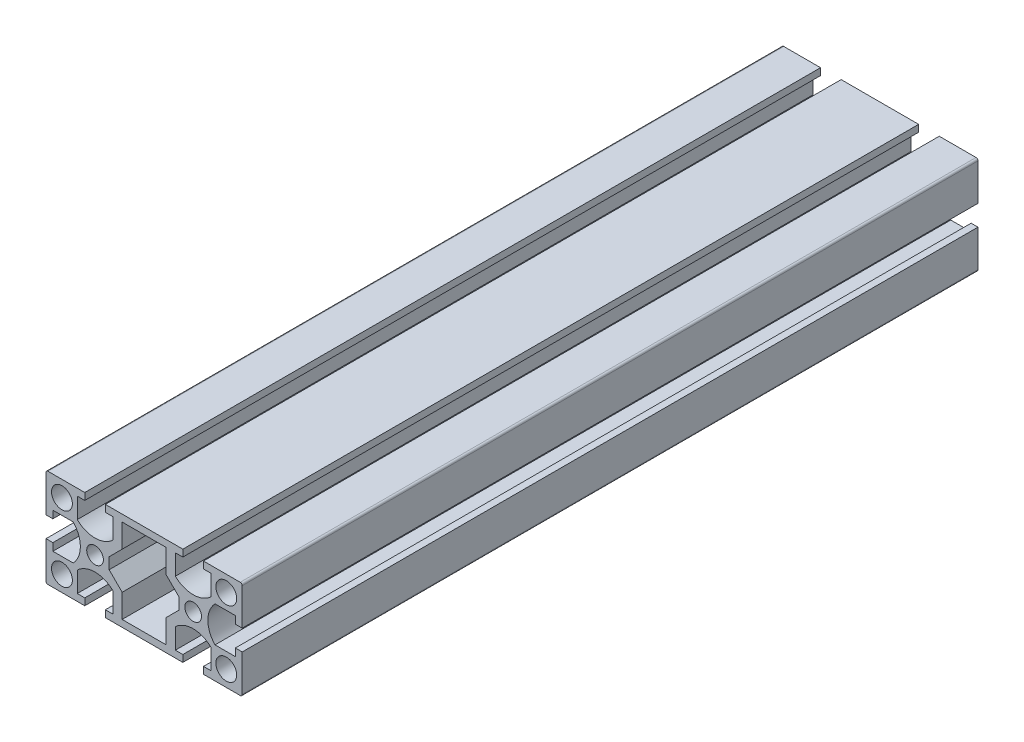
ISO-10303-21;
HEADER;
FILE_DESCRIPTION(('STEP AP214'),'2;1');
FILE_NAME('part.step','',(''),(''),'','','');
FILE_SCHEMA(('AUTOMOTIVE_DESIGN { 1 0 10303 214 1 1 1 1 }'));
ENDSEC;
DATA;
#1=APPLICATION_CONTEXT('core data for automotive mechanical design processes');
#2=APPLICATION_PROTOCOL_DEFINITION('international standard','automotive_design',2000,#1);
#3=PRODUCT_CONTEXT('',#1,'mechanical');
#4=PRODUCT('Part','Part','',(#3));
#5=PRODUCT_RELATED_PRODUCT_CATEGORY('part','',(#4));
#6=PRODUCT_DEFINITION_FORMATION('','',#4);
#7=PRODUCT_DEFINITION_CONTEXT('part definition',#1,'design');
#8=PRODUCT_DEFINITION('design','',#6,#7);
#9=PRODUCT_DEFINITION_SHAPE('','',#8);
#10=(LENGTH_UNIT() NAMED_UNIT(*) SI_UNIT(.MILLI.,.METRE.));
#11=(NAMED_UNIT(*) PLANE_ANGLE_UNIT() SI_UNIT($,.RADIAN.));
#12=(NAMED_UNIT(*) SI_UNIT($,.STERADIAN.) SOLID_ANGLE_UNIT());
#13=UNCERTAINTY_MEASURE_WITH_UNIT(LENGTH_MEASURE(1.E-05),#10,'distance_accuracy_value','');
#14=(GEOMETRIC_REPRESENTATION_CONTEXT(3) GLOBAL_UNCERTAINTY_ASSIGNED_CONTEXT((#13)) GLOBAL_UNIT_ASSIGNED_CONTEXT((#10,
#11,#12)) REPRESENTATION_CONTEXT('',''));
#15=CARTESIAN_POINT('',(0.,0.,0.));
#16=DIRECTION('',(0.,0.,1.));
#17=DIRECTION('',(1.,0.,0.));
#18=AXIS2_PLACEMENT_3D('',#15,#16,#17);
#19=CARTESIAN_POINT('',(36.5,0.,150.));
#20=DIRECTION('',(0.,0.,1.));
#21=DIRECTION('',(1.,0.,0.));
#22=AXIS2_PLACEMENT_3D('',#19,#20,#21);
#23=PLANE('',#22);
#24=CARTESIAN_POINT('',(20.,0.,150.));
#25=DIRECTION('',(0.,0.,1.));
#26=DIRECTION('',(1.,0.,0.));
#27=AXIS2_PLACEMENT_3D('',#24,#25,#26);
#28=CIRCLE('',#27,3.4);
#29=CARTESIAN_POINT('',(23.4,0.,150.));
#30=VERTEX_POINT('',#29);
#31=EDGE_CURVE('E1890',#30,#30,#28,.T.);
#32=ORIENTED_EDGE('',*,*,#31,.F.);
#33=EDGE_LOOP('',(#32));
#34=FACE_BOUND('',#33,.T.);
#35=CARTESIAN_POINT('',(-20.,0.,150.));
#36=DIRECTION('',(0.,0.,1.));
#37=DIRECTION('',(1.,0.,0.));
#38=AXIS2_PLACEMENT_3D('',#35,#36,#37);
#39=CIRCLE('',#38,3.4);
#40=CARTESIAN_POINT('',(-16.6,0.,150.));
#41=VERTEX_POINT('',#40);
#42=EDGE_CURVE('E506',#41,#41,#39,.T.);
#43=ORIENTED_EDGE('',*,*,#42,.F.);
#44=EDGE_LOOP('',(#43));
#45=FACE_BOUND('',#44,.T.);
#46=CARTESIAN_POINT('',(-33.5,-13.5,150.));
#47=DIRECTION('',(0.,0.,1.));
#48=DIRECTION('',(1.,0.,0.));
#49=AXIS2_PLACEMENT_3D('',#46,#47,#48);
#50=CIRCLE('',#49,4.25);
#51=CARTESIAN_POINT('',(-29.25,-13.5,150.));
#52=VERTEX_POINT('',#51);
#53=EDGE_CURVE('E556',#52,#52,#50,.T.);
#54=ORIENTED_EDGE('',*,*,#53,.F.);
#55=EDGE_LOOP('',(#54));
#56=FACE_BOUND('',#55,.T.);
#57=CARTESIAN_POINT('',(36.5,0.,150.));
#58=DIRECTION('',(0.,0.,-1.));
#59=DIRECTION('',(1.,0.,0.));
#60=AXIS2_PLACEMENT_3D('',#57,#58,#59);
#61=CIRCLE('',#60,10.5000000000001);
#62=CARTESIAN_POINT('',(28.9047712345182,-7.25000000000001,150.));
#63=VERTEX_POINT('',#62);
#64=CARTESIAN_POINT('',(28.9047712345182,7.24999999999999,150.));
#65=VERTEX_POINT('',#64);
#66=EDGE_CURVE('E568',#63,#65,#61,.T.);
#67=ORIENTED_EDGE('',*,*,#66,.T.);
#68=DIRECTION('',(1.,0.,0.));
#69=VECTOR('',#68,1.);
#70=CARTESIAN_POINT('',(28.9047712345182,7.24999999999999,150.));
#71=LINE('',#70,#69);
#72=CARTESIAN_POINT('',(37.2000000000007,7.24999999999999,150.));
#73=VERTEX_POINT('',#72);
#74=EDGE_CURVE('E571',#65,#73,#71,.T.);
#75=ORIENTED_EDGE('',*,*,#74,.T.);
#76=DIRECTION('',(0.,-1.,0.));
#77=VECTOR('',#76,1.);
#78=CARTESIAN_POINT('',(37.2000000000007,7.24999999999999,150.));
#79=LINE('',#78,#77);
#80=CARTESIAN_POINT('',(37.2000000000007,4.1999999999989,150.));
#81=VERTEX_POINT('',#80);
#82=EDGE_CURVE('E574',#73,#81,#79,.T.);
#83=ORIENTED_EDGE('',*,*,#82,.T.);
#84=DIRECTION('',(1.,0.,0.));
#85=VECTOR('',#84,1.);
#86=CARTESIAN_POINT('',(37.2000000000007,4.1999999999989,150.));
#87=LINE('',#86,#85);
#88=CARTESIAN_POINT('',(40.,4.1999999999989,150.));
#89=VERTEX_POINT('',#88);
#90=EDGE_CURVE('E576',#81,#89,#87,.T.);
#91=ORIENTED_EDGE('',*,*,#90,.T.);
#92=DIRECTION('',(0.,1.,0.));
#93=VECTOR('',#92,1.);
#94=CARTESIAN_POINT('',(40.,4.1999999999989,150.));
#95=LINE('',#94,#93);
#96=CARTESIAN_POINT('',(40.,19.1999999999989,150.));
#97=VERTEX_POINT('',#96);
#98=EDGE_CURVE('E578',#89,#97,#95,.T.);
#99=ORIENTED_EDGE('',*,*,#98,.T.);
#100=CARTESIAN_POINT('',(39.1999999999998,19.1999999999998,150.));
#101=DIRECTION('',(0.,0.,1.));
#102=DIRECTION('',(1.,0.,0.));
#103=AXIS2_PLACEMENT_3D('',#100,#101,#102);
#104=CIRCLE('',#103,0.800000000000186);
#105=CARTESIAN_POINT('',(39.2000000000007,20.,150.));
#106=VERTEX_POINT('',#105);
#107=EDGE_CURVE('E580',#97,#106,#104,.T.);
#108=ORIENTED_EDGE('',*,*,#107,.T.);
#109=DIRECTION('',(-1.,0.,0.));
#110=VECTOR('',#109,1.);
#111=CARTESIAN_POINT('',(39.2000000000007,20.,150.));
#112=LINE('',#111,#110);
#113=CARTESIAN_POINT('',(24.2000000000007,20.,150.));
#114=VERTEX_POINT('',#113);
#115=EDGE_CURVE('E582',#106,#114,#112,.T.);
#116=ORIENTED_EDGE('',*,*,#115,.T.);
#117=DIRECTION('',(0.,-1.,0.));
#118=VECTOR('',#117,1.);
#119=CARTESIAN_POINT('',(24.2000000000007,20.,150.));
#120=LINE('',#119,#118);
#121=CARTESIAN_POINT('',(24.2000000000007,17.2000000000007,150.));
#122=VERTEX_POINT('',#121);
#123=EDGE_CURVE('E584',#114,#122,#120,.T.);
#124=ORIENTED_EDGE('',*,*,#123,.T.);
#125=DIRECTION('',(1.,0.,0.));
#126=VECTOR('',#125,1.);
#127=CARTESIAN_POINT('',(24.2000000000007,17.2000000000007,150.));
#128=LINE('',#127,#126);
#129=CARTESIAN_POINT('',(27.25,17.2000000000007,150.));
#130=VERTEX_POINT('',#129);
#131=EDGE_CURVE('E586',#122,#130,#128,.T.);
#132=ORIENTED_EDGE('',*,*,#131,.T.);
#133=DIRECTION('',(0.,-1.,0.));
#134=VECTOR('',#133,1.);
#135=CARTESIAN_POINT('',(27.25,17.2000000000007,150.));
#136=LINE('',#135,#134);
#137=CARTESIAN_POINT('',(27.25,8.90477123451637,150.));
#138=VERTEX_POINT('',#137);
#139=EDGE_CURVE('E588',#130,#138,#136,.T.);
#140=ORIENTED_EDGE('',*,*,#139,.T.);
#141=CARTESIAN_POINT('',(20.,16.4999999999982,150.));
#142=DIRECTION('',(0.,0.,-1.));
#143=DIRECTION('',(1.,0.,0.));
#144=AXIS2_PLACEMENT_3D('',#141,#142,#143);
#145=CIRCLE('',#144,10.5000000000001);
#146=CARTESIAN_POINT('',(12.75,8.90477123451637,150.));
#147=VERTEX_POINT('',#146);
#148=EDGE_CURVE('E590',#138,#147,#145,.T.);
#149=ORIENTED_EDGE('',*,*,#148,.T.);
#150=DIRECTION('',(0.,1.,0.));
#151=VECTOR('',#150,1.);
#152=CARTESIAN_POINT('',(12.75,8.90477123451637,150.));
#153=LINE('',#152,#151);
#154=CARTESIAN_POINT('',(12.75,17.2000000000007,150.));
#155=VERTEX_POINT('',#154);
#156=EDGE_CURVE('E592',#147,#155,#153,.T.);
#157=ORIENTED_EDGE('',*,*,#156,.T.);
#158=DIRECTION('',(1.,0.,0.));
#159=VECTOR('',#158,1.);
#160=CARTESIAN_POINT('',(12.75,17.2000000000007,150.));
#161=LINE('',#160,#159);
#162=CARTESIAN_POINT('',(15.8000000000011,17.2000000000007,150.));
#163=VERTEX_POINT('',#162);
#164=EDGE_CURVE('E594',#155,#163,#161,.T.);
#165=ORIENTED_EDGE('',*,*,#164,.T.);
#166=DIRECTION('',(0.,1.,0.));
#167=VECTOR('',#166,1.);
#168=CARTESIAN_POINT('',(15.8000000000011,17.2000000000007,150.));
#169=LINE('',#168,#167);
#170=CARTESIAN_POINT('',(15.8000000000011,20.,150.));
#171=VERTEX_POINT('',#170);
#172=EDGE_CURVE('E596',#163,#171,#169,.T.);
#173=ORIENTED_EDGE('',*,*,#172,.T.);
#174=DIRECTION('',(-1.,0.,0.));
#175=VECTOR('',#174,1.);
#176=CARTESIAN_POINT('',(15.8000000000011,20.,150.));
#177=LINE('',#176,#175);
#178=CARTESIAN_POINT('',(-15.7999999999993,20.,150.));
#179=VERTEX_POINT('',#178);
#180=EDGE_CURVE('E598',#171,#179,#177,.T.);
#181=ORIENTED_EDGE('',*,*,#180,.T.);
#182=DIRECTION('',(0.,-1.,0.));
#183=VECTOR('',#182,1.);
#184=CARTESIAN_POINT('',(-15.7999999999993,20.,150.));
#185=LINE('',#184,#183);
#186=CARTESIAN_POINT('',(-15.7999999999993,17.2000000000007,150.));
#187=VERTEX_POINT('',#186);
#188=EDGE_CURVE('E600',#179,#187,#185,.T.);
#189=ORIENTED_EDGE('',*,*,#188,.T.);
#190=DIRECTION('',(1.,0.,0.));
#191=VECTOR('',#190,1.);
#192=CARTESIAN_POINT('',(-15.7999999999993,17.2000000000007,150.));
#193=LINE('',#192,#191);
#194=CARTESIAN_POINT('',(-12.75,17.2000000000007,150.));
#195=VERTEX_POINT('',#194);
#196=EDGE_CURVE('E602',#187,#195,#193,.T.);
#197=ORIENTED_EDGE('',*,*,#196,.T.);
#198=DIRECTION('',(0.,-1.,0.));
#199=VECTOR('',#198,1.);
#200=CARTESIAN_POINT('',(-12.75,17.2000000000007,150.));
#201=LINE('',#200,#199);
#202=CARTESIAN_POINT('',(-12.75,8.90477123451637,150.));
#203=VERTEX_POINT('',#202);
#204=EDGE_CURVE('E604',#195,#203,#201,.T.);
#205=ORIENTED_EDGE('',*,*,#204,.T.);
#206=CARTESIAN_POINT('',(-20.,16.4999999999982,150.));
#207=DIRECTION('',(0.,0.,-1.));
#208=DIRECTION('',(1.,0.,0.));
#209=AXIS2_PLACEMENT_3D('',#206,#207,#208);
#210=CIRCLE('',#209,10.5000000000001);
#211=CARTESIAN_POINT('',(-27.25,8.90477123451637,150.));
#212=VERTEX_POINT('',#211);
#213=EDGE_CURVE('E606',#203,#212,#210,.T.);
#214=ORIENTED_EDGE('',*,*,#213,.T.);
#215=DIRECTION('',(0.,1.,0.));
#216=VECTOR('',#215,1.);
#217=CARTESIAN_POINT('',(-27.25,8.90477123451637,150.));
#218=LINE('',#217,#216);
#219=CARTESIAN_POINT('',(-27.25,17.2000000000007,150.));
#220=VERTEX_POINT('',#219);
#221=EDGE_CURVE('E608',#212,#220,#218,.T.);
#222=ORIENTED_EDGE('',*,*,#221,.T.);
#223=DIRECTION('',(1.,0.,0.));
#224=VECTOR('',#223,1.);
#225=CARTESIAN_POINT('',(-27.25,17.2000000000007,150.));
#226=LINE('',#225,#224);
#227=CARTESIAN_POINT('',(-24.1999999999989,17.2000000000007,150.));
#228=VERTEX_POINT('',#227);
#229=EDGE_CURVE('E610',#220,#228,#226,.T.);
#230=ORIENTED_EDGE('',*,*,#229,.T.);
#231=DIRECTION('',(0.,1.,0.));
#232=VECTOR('',#231,1.);
#233=CARTESIAN_POINT('',(-24.1999999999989,17.2000000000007,150.));
#234=LINE('',#233,#232);
#235=CARTESIAN_POINT('',(-24.1999999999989,20.,150.));
#236=VERTEX_POINT('',#235);
#237=EDGE_CURVE('E612',#228,#236,#234,.T.);
#238=ORIENTED_EDGE('',*,*,#237,.T.);
#239=DIRECTION('',(-1.,0.,0.));
#240=VECTOR('',#239,1.);
#241=CARTESIAN_POINT('',(-24.1999999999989,20.,150.));
#242=LINE('',#241,#240);
#243=CARTESIAN_POINT('',(-39.1999999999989,20.,150.));
#244=VERTEX_POINT('',#243);
#245=EDGE_CURVE('E614',#236,#244,#242,.T.);
#246=ORIENTED_EDGE('',*,*,#245,.T.);
#247=CARTESIAN_POINT('',(-39.1999999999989,19.1999999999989,150.));
#248=DIRECTION('',(0.,0.,1.));
#249=DIRECTION('',(1.,0.,0.));
#250=AXIS2_PLACEMENT_3D('',#247,#248,#249);
#251=CIRCLE('',#250,0.800000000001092);
#252=CARTESIAN_POINT('',(-40.,19.1999999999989,150.));
#253=VERTEX_POINT('',#252);
#254=EDGE_CURVE('E616',#244,#253,#251,.T.);
#255=ORIENTED_EDGE('',*,*,#254,.T.);
#256=DIRECTION('',(0.,-1.,0.));
#257=VECTOR('',#256,1.);
#258=CARTESIAN_POINT('',(-40.,19.1999999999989,150.));
#259=LINE('',#258,#257);
#260=CARTESIAN_POINT('',(-40.,4.1999999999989,150.));
#261=VERTEX_POINT('',#260);
#262=EDGE_CURVE('E618',#253,#261,#259,.T.);
#263=ORIENTED_EDGE('',*,*,#262,.T.);
#264=DIRECTION('',(1.,0.,0.));
#265=VECTOR('',#264,1.);
#266=CARTESIAN_POINT('',(-40.,4.1999999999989,150.));
#267=LINE('',#266,#265);
#268=CARTESIAN_POINT('',(-37.1999999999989,4.1999999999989,150.));
#269=VERTEX_POINT('',#268);
#270=EDGE_CURVE('E620',#261,#269,#267,.T.);
#271=ORIENTED_EDGE('',*,*,#270,.T.);
#272=DIRECTION('',(0.,1.,0.));
#273=VECTOR('',#272,1.);
#274=CARTESIAN_POINT('',(-37.1999999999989,4.1999999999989,150.));
#275=LINE('',#274,#273);
#276=CARTESIAN_POINT('',(-37.1999999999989,7.24999999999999,150.));
#277=VERTEX_POINT('',#276);
#278=EDGE_CURVE('E622',#269,#277,#275,.T.);
#279=ORIENTED_EDGE('',*,*,#278,.T.);
#280=DIRECTION('',(1.,0.,0.));
#281=VECTOR('',#280,1.);
#282=CARTESIAN_POINT('',(-37.1999999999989,7.24999999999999,150.));
#283=LINE('',#282,#281);
#284=CARTESIAN_POINT('',(-28.9047712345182,7.24999999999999,150.));
#285=VERTEX_POINT('',#284);
#286=EDGE_CURVE('E624',#277,#285,#283,.T.);
#287=ORIENTED_EDGE('',*,*,#286,.T.);
#288=CARTESIAN_POINT('',(-36.5,0.,150.));
#289=DIRECTION('',(0.,0.,-1.));
#290=DIRECTION('',(1.,0.,0.));
#291=AXIS2_PLACEMENT_3D('',#288,#289,#290);
#292=CIRCLE('',#291,10.5000000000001);
#293=CARTESIAN_POINT('',(-28.9047712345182,-7.25000000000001,150.));
#294=VERTEX_POINT('',#293);
#295=EDGE_CURVE('E626',#285,#294,#292,.T.);
#296=ORIENTED_EDGE('',*,*,#295,.T.);
#297=DIRECTION('',(-1.,0.,0.));
#298=VECTOR('',#297,1.);
#299=CARTESIAN_POINT('',(-28.9047712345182,-7.25000000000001,150.));
#300=LINE('',#299,#298);
#301=CARTESIAN_POINT('',(-37.1999999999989,-7.25000000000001,150.));
#302=VERTEX_POINT('',#301);
#303=EDGE_CURVE('E628',#294,#302,#300,.T.);
#304=ORIENTED_EDGE('',*,*,#303,.T.);
#305=DIRECTION('',(0.,1.,0.));
#306=VECTOR('',#305,1.);
#307=CARTESIAN_POINT('',(-37.1999999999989,-7.25000000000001,150.));
#308=LINE('',#307,#306);
#309=CARTESIAN_POINT('',(-37.1999999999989,-4.20000000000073,150.));
#310=VERTEX_POINT('',#309);
#311=EDGE_CURVE('E630',#302,#310,#308,.T.);
#312=ORIENTED_EDGE('',*,*,#311,.T.);
#313=DIRECTION('',(-1.,0.,0.));
#314=VECTOR('',#313,1.);
#315=CARTESIAN_POINT('',(-37.1999999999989,-4.20000000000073,150.));
#316=LINE('',#315,#314);
#317=CARTESIAN_POINT('',(-40.,-4.20000000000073,150.));
#318=VERTEX_POINT('',#317);
#319=EDGE_CURVE('E632',#310,#318,#316,.T.);
#320=ORIENTED_EDGE('',*,*,#319,.T.);
#321=DIRECTION('',(0.,-1.,0.));
#322=VECTOR('',#321,1.);
#323=CARTESIAN_POINT('',(-40.,-4.20000000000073,150.));
#324=LINE('',#323,#322);
#325=CARTESIAN_POINT('',(-40.,-19.2000000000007,150.));
#326=VERTEX_POINT('',#325);
#327=EDGE_CURVE('E634',#318,#326,#324,.T.);
#328=ORIENTED_EDGE('',*,*,#327,.T.);
#329=CARTESIAN_POINT('',(-39.2000000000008,-19.2000000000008,150.));
#330=DIRECTION('',(0.,0.,1.));
#331=DIRECTION('',(1.,0.,0.));
#332=AXIS2_PLACEMENT_3D('',#329,#330,#331);
#333=CIRCLE('',#332,0.799999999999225);
#334=CARTESIAN_POINT('',(-39.1999999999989,-20.,150.));
#335=VERTEX_POINT('',#334);
#336=EDGE_CURVE('E636',#326,#335,#333,.T.);
#337=ORIENTED_EDGE('',*,*,#336,.T.);
#338=DIRECTION('',(1.,0.,0.));
#339=VECTOR('',#338,1.);
#340=CARTESIAN_POINT('',(-39.1999999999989,-20.,150.));
#341=LINE('',#340,#339);
#342=CARTESIAN_POINT('',(-24.1999999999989,-20.,150.));
#343=VERTEX_POINT('',#342);
#344=EDGE_CURVE('E638',#335,#343,#341,.T.);
#345=ORIENTED_EDGE('',*,*,#344,.T.);
#346=DIRECTION('',(0.,1.,0.));
#347=VECTOR('',#346,1.);
#348=CARTESIAN_POINT('',(-24.1999999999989,-20.,150.));
#349=LINE('',#348,#347);
#350=CARTESIAN_POINT('',(-24.1999999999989,-17.2000000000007,150.));
#351=VERTEX_POINT('',#350);
#352=EDGE_CURVE('E640',#343,#351,#349,.T.);
#353=ORIENTED_EDGE('',*,*,#352,.T.);
#354=DIRECTION('',(-1.,0.,0.));
#355=VECTOR('',#354,1.);
#356=CARTESIAN_POINT('',(-24.1999999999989,-17.2000000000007,150.));
#357=LINE('',#356,#355);
#358=CARTESIAN_POINT('',(-27.25,-17.2000000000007,150.));
#359=VERTEX_POINT('',#358);
#360=EDGE_CURVE('E642',#351,#359,#357,.T.);
#361=ORIENTED_EDGE('',*,*,#360,.T.);
#362=DIRECTION('',(0.,1.,0.));
#363=VECTOR('',#362,1.);
#364=CARTESIAN_POINT('',(-27.25,-17.2000000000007,150.));
#365=LINE('',#364,#363);
#366=CARTESIAN_POINT('',(-27.25,-8.90477123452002,150.));
#367=VERTEX_POINT('',#366);
#368=EDGE_CURVE('E644',#359,#367,#365,.T.);
#369=ORIENTED_EDGE('',*,*,#368,.T.);
#370=CARTESIAN_POINT('',(-20.,-16.5000000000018,150.));
#371=DIRECTION('',(0.,0.,-1.));
#372=DIRECTION('',(1.,0.,0.));
#373=AXIS2_PLACEMENT_3D('',#370,#371,#372);
#374=CIRCLE('',#373,10.5000000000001);
#375=CARTESIAN_POINT('',(-12.75,-8.90477123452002,150.));
#376=VERTEX_POINT('',#375);
#377=EDGE_CURVE('E646',#367,#376,#374,.T.);
#378=ORIENTED_EDGE('',*,*,#377,.T.);
#379=DIRECTION('',(0.,-1.,0.));
#380=VECTOR('',#379,1.);
#381=CARTESIAN_POINT('',(-12.75,-8.90477123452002,150.));
#382=LINE('',#381,#380);
#383=CARTESIAN_POINT('',(-12.75,-17.2000000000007,150.));
#384=VERTEX_POINT('',#383);
#385=EDGE_CURVE('E648',#376,#384,#382,.T.);
#386=ORIENTED_EDGE('',*,*,#385,.T.);
#387=DIRECTION('',(-1.,0.,0.));
#388=VECTOR('',#387,1.);
#389=CARTESIAN_POINT('',(-12.75,-17.2000000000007,150.));
#390=LINE('',#389,#388);
#391=CARTESIAN_POINT('',(-15.7999999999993,-17.2000000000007,150.));
#392=VERTEX_POINT('',#391);
#393=EDGE_CURVE('E650',#384,#392,#390,.T.);
#394=ORIENTED_EDGE('',*,*,#393,.T.);
#395=DIRECTION('',(0.,-1.,0.));
#396=VECTOR('',#395,1.);
#397=CARTESIAN_POINT('',(-15.7999999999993,-17.2000000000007,150.));
#398=LINE('',#397,#396);
#399=CARTESIAN_POINT('',(-15.7999999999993,-20.,150.));
#400=VERTEX_POINT('',#399);
#401=EDGE_CURVE('E652',#392,#400,#398,.T.);
#402=ORIENTED_EDGE('',*,*,#401,.T.);
#403=DIRECTION('',(1.,0.,0.));
#404=VECTOR('',#403,1.);
#405=CARTESIAN_POINT('',(-15.7999999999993,-20.,150.));
#406=LINE('',#405,#404);
#407=CARTESIAN_POINT('',(15.8000000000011,-20.,150.));
#408=VERTEX_POINT('',#407);
#409=EDGE_CURVE('E654',#400,#408,#406,.T.);
#410=ORIENTED_EDGE('',*,*,#409,.T.);
#411=DIRECTION('',(0.,1.,0.));
#412=VECTOR('',#411,1.);
#413=CARTESIAN_POINT('',(15.8000000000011,-20.,150.));
#414=LINE('',#413,#412);
#415=CARTESIAN_POINT('',(15.8000000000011,-17.2000000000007,150.));
#416=VERTEX_POINT('',#415);
#417=EDGE_CURVE('E656',#408,#416,#414,.T.);
#418=ORIENTED_EDGE('',*,*,#417,.T.);
#419=DIRECTION('',(-1.,0.,0.));
#420=VECTOR('',#419,1.);
#421=CARTESIAN_POINT('',(15.8000000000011,-17.2000000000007,150.));
#422=LINE('',#421,#420);
#423=CARTESIAN_POINT('',(12.75,-17.2000000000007,150.));
#424=VERTEX_POINT('',#423);
#425=EDGE_CURVE('E658',#416,#424,#422,.T.);
#426=ORIENTED_EDGE('',*,*,#425,.T.);
#427=DIRECTION('',(0.,1.,0.));
#428=VECTOR('',#427,1.);
#429=CARTESIAN_POINT('',(12.75,-17.2000000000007,150.));
#430=LINE('',#429,#428);
#431=CARTESIAN_POINT('',(12.75,-8.90477123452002,150.));
#432=VERTEX_POINT('',#431);
#433=EDGE_CURVE('E660',#424,#432,#430,.T.);
#434=ORIENTED_EDGE('',*,*,#433,.T.);
#435=CARTESIAN_POINT('',(20.,-16.5000000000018,150.));
#436=DIRECTION('',(0.,0.,-1.));
#437=DIRECTION('',(1.,0.,0.));
#438=AXIS2_PLACEMENT_3D('',#435,#436,#437);
#439=CIRCLE('',#438,10.5000000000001);
#440=CARTESIAN_POINT('',(27.25,-8.90477123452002,150.));
#441=VERTEX_POINT('',#440);
#442=EDGE_CURVE('E662',#432,#441,#439,.T.);
#443=ORIENTED_EDGE('',*,*,#442,.T.);
#444=DIRECTION('',(0.,-1.,0.));
#445=VECTOR('',#444,1.);
#446=CARTESIAN_POINT('',(27.25,-8.90477123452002,150.));
#447=LINE('',#446,#445);
#448=CARTESIAN_POINT('',(27.25,-17.2000000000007,150.));
#449=VERTEX_POINT('',#448);
#450=EDGE_CURVE('E664',#441,#449,#447,.T.);
#451=ORIENTED_EDGE('',*,*,#450,.T.);
#452=DIRECTION('',(-1.,0.,0.));
#453=VECTOR('',#452,1.);
#454=CARTESIAN_POINT('',(27.25,-17.2000000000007,150.));
#455=LINE('',#454,#453);
#456=CARTESIAN_POINT('',(24.2000000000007,-17.2000000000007,150.));
#457=VERTEX_POINT('',#456);
#458=EDGE_CURVE('E666',#449,#457,#455,.T.);
#459=ORIENTED_EDGE('',*,*,#458,.T.);
#460=DIRECTION('',(0.,-1.,0.));
#461=VECTOR('',#460,1.);
#462=CARTESIAN_POINT('',(24.2000000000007,-17.2000000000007,150.));
#463=LINE('',#462,#461);
#464=CARTESIAN_POINT('',(24.2000000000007,-20.,150.));
#465=VERTEX_POINT('',#464);
#466=EDGE_CURVE('E668',#457,#465,#463,.T.);
#467=ORIENTED_EDGE('',*,*,#466,.T.);
#468=DIRECTION('',(1.,0.,0.));
#469=VECTOR('',#468,1.);
#470=CARTESIAN_POINT('',(24.2000000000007,-20.,150.));
#471=LINE('',#470,#469);
#472=CARTESIAN_POINT('',(39.2000000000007,-20.,150.));
#473=VERTEX_POINT('',#472);
#474=EDGE_CURVE('E670',#465,#473,#471,.T.);
#475=ORIENTED_EDGE('',*,*,#474,.T.);
#476=CARTESIAN_POINT('',(39.2000000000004,-19.2000000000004,150.));
#477=DIRECTION('',(0.,0.,1.));
#478=DIRECTION('',(1.,0.,0.));
#479=AXIS2_PLACEMENT_3D('',#476,#477,#478);
#480=CIRCLE('',#479,0.799999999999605);
#481=CARTESIAN_POINT('',(40.,-19.2000000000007,150.));
#482=VERTEX_POINT('',#481);
#483=EDGE_CURVE('E672',#473,#482,#480,.T.);
#484=ORIENTED_EDGE('',*,*,#483,.T.);
#485=DIRECTION('',(0.,1.,0.));
#486=VECTOR('',#485,1.);
#487=CARTESIAN_POINT('',(40.,-19.2000000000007,150.));
#488=LINE('',#487,#486);
#489=CARTESIAN_POINT('',(40.,-4.20000000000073,150.));
#490=VERTEX_POINT('',#489);
#491=EDGE_CURVE('E674',#482,#490,#488,.T.);
#492=ORIENTED_EDGE('',*,*,#491,.T.);
#493=DIRECTION('',(-1.,0.,0.));
#494=VECTOR('',#493,1.);
#495=CARTESIAN_POINT('',(40.,-4.20000000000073,150.));
#496=LINE('',#495,#494);
#497=CARTESIAN_POINT('',(37.2000000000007,-4.20000000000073,150.));
#498=VERTEX_POINT('',#497);
#499=EDGE_CURVE('E676',#490,#498,#496,.T.);
#500=ORIENTED_EDGE('',*,*,#499,.T.);
#501=DIRECTION('',(0.,-1.,0.));
#502=VECTOR('',#501,1.);
#503=CARTESIAN_POINT('',(37.2000000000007,-4.20000000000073,150.));
#504=LINE('',#503,#502);
#505=CARTESIAN_POINT('',(37.2000000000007,-7.25000000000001,150.));
#506=VERTEX_POINT('',#505);
#507=EDGE_CURVE('E678',#498,#506,#504,.T.);
#508=ORIENTED_EDGE('',*,*,#507,.T.);
#509=DIRECTION('',(-1.,0.,0.));
#510=VECTOR('',#509,1.);
#511=CARTESIAN_POINT('',(37.2000000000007,-7.25000000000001,150.));
#512=LINE('',#511,#510);
#513=EDGE_CURVE('E680',#506,#63,#512,.T.);
#514=ORIENTED_EDGE('',*,*,#513,.T.);
#515=EDGE_LOOP('',(#67,#75,#83,#91,#99,#108,#116,#124,#132,#140,#149,#157,#165,#173,#181,#189,
#197,#205,#214,#222,#230,#238,#246,#255,#263,#271,#279,#287,#296,#304,#312,#320,#328,#337,#345,
#353,#361,#369,#378,#386,#394,#402,#410,#418,#426,#434,#443,#451,#459,#467,#475,#484,#492,#500,
#508,#514));
#516=FACE_BOUND('',#515,.T.);
#517=CARTESIAN_POINT('',(33.5,-13.5,150.));
#518=DIRECTION('',(0.,0.,1.));
#519=DIRECTION('',(1.,0.,0.));
#520=AXIS2_PLACEMENT_3D('',#517,#518,#519);
#521=CIRCLE('',#520,4.25);
#522=CARTESIAN_POINT('',(37.75,-13.5,150.));
#523=VERTEX_POINT('',#522);
#524=EDGE_CURVE('E562',#523,#523,#521,.T.);
#525=ORIENTED_EDGE('',*,*,#524,.F.);
#526=EDGE_LOOP('',(#525));
#527=FACE_BOUND('',#526,.T.);
#528=DIRECTION('',(0.707106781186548,0.707106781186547,0.));
#529=VECTOR('',#528,1.);
#530=CARTESIAN_POINT('',(8.95000000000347,-7.59999999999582,150.));
#531=LINE('',#530,#529);
#532=CARTESIAN_POINT('',(8.95000000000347,-7.59999999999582,150.));
#533=VERTEX_POINT('',#532);
#534=CARTESIAN_POINT('',(14.2500000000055,-2.29999999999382,150.));
#535=VERTEX_POINT('',#534);
#536=EDGE_CURVE('E468',#533,#535,#531,.T.);
#537=ORIENTED_EDGE('',*,*,#536,.F.);
#538=DIRECTION('',(0.,1.,0.));
#539=VECTOR('',#538,1.);
#540=CARTESIAN_POINT('',(8.95000000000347,-17.199999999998,150.));
#541=LINE('',#540,#539);
#542=CARTESIAN_POINT('',(8.95000000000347,-17.199999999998,150.));
#543=VERTEX_POINT('',#542);
#544=EDGE_CURVE('E460',#543,#533,#541,.T.);
#545=ORIENTED_EDGE('',*,*,#544,.F.);
#546=DIRECTION('',(1.,0.,0.));
#547=VECTOR('',#546,1.);
#548=CARTESIAN_POINT('',(-8.94999999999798,-17.199999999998,150.));
#549=LINE('',#548,#547);
#550=CARTESIAN_POINT('',(-8.94999999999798,-17.199999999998,150.));
#551=VERTEX_POINT('',#550);
#552=EDGE_CURVE('E503',#551,#543,#549,.T.);
#553=ORIENTED_EDGE('',*,*,#552,.F.);
#554=DIRECTION('',(0.,-1.,0.));
#555=VECTOR('',#554,1.);
#556=CARTESIAN_POINT('',(-8.94999999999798,-7.59999999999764,150.));
#557=LINE('',#556,#555);
#558=CARTESIAN_POINT('',(-8.94999999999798,-7.59999999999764,150.));
#559=VERTEX_POINT('',#558);
#560=EDGE_CURVE('E501',#559,#551,#557,.T.);
#561=ORIENTED_EDGE('',*,*,#560,.F.);
#562=DIRECTION('',(0.707106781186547,-0.707106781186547,0.));
#563=VECTOR('',#562,1.);
#564=CARTESIAN_POINT('',(-14.25,-2.29999999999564,150.));
#565=LINE('',#564,#563);
#566=CARTESIAN_POINT('',(-14.25,-2.29999999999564,150.));
#567=VERTEX_POINT('',#566);
#568=EDGE_CURVE('E499',#567,#559,#565,.T.);
#569=ORIENTED_EDGE('',*,*,#568,.F.);
#570=DIRECTION('',(0.,-1.,0.));
#571=VECTOR('',#570,1.);
#572=CARTESIAN_POINT('',(-14.25,2.3000000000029,150.));
#573=LINE('',#572,#571);
#574=CARTESIAN_POINT('',(-14.25,2.3000000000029,150.));
#575=VERTEX_POINT('',#574);
#576=EDGE_CURVE('E497',#575,#567,#573,.T.);
#577=ORIENTED_EDGE('',*,*,#576,.F.);
#578=DIRECTION('',(-0.707106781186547,-0.707106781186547,0.));
#579=VECTOR('',#578,1.);
#580=CARTESIAN_POINT('',(-8.95000000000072,7.60000000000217,150.));
#581=LINE('',#580,#579);
#582=CARTESIAN_POINT('',(-8.95000000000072,7.60000000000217,150.));
#583=VERTEX_POINT('',#582);
#584=EDGE_CURVE('E495',#583,#575,#581,.T.);
#585=ORIENTED_EDGE('',*,*,#584,.F.);
#586=DIRECTION('',(0.,-1.,0.));
#587=VECTOR('',#586,1.);
#588=CARTESIAN_POINT('',(-8.95000000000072,17.1999999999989,150.));
#589=LINE('',#588,#587);
#590=CARTESIAN_POINT('',(-8.95000000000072,17.1999999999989,150.));
#591=VERTEX_POINT('',#590);
#592=EDGE_CURVE('E493',#591,#583,#589,.T.);
#593=ORIENTED_EDGE('',*,*,#592,.F.);
#594=DIRECTION('',(-1.,0.,0.));
#595=VECTOR('',#594,1.);
#596=CARTESIAN_POINT('',(8.9500000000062,17.1999999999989,150.));
#597=LINE('',#596,#595);
#598=CARTESIAN_POINT('',(8.9500000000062,17.1999999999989,150.));
#599=VERTEX_POINT('',#598);
#600=EDGE_CURVE('E491',#599,#591,#597,.T.);
#601=ORIENTED_EDGE('',*,*,#600,.F.);
#602=DIRECTION('',(0.,1.,0.));
#603=VECTOR('',#602,1.);
#604=CARTESIAN_POINT('',(8.9500000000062,7.600000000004,150.));
#605=LINE('',#604,#603);
#606=CARTESIAN_POINT('',(8.9500000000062,7.600000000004,150.));
#607=VERTEX_POINT('',#606);
#608=EDGE_CURVE('E489',#607,#599,#605,.T.);
#609=ORIENTED_EDGE('',*,*,#608,.F.);
#610=DIRECTION('',(-0.707106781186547,0.707106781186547,0.));
#611=VECTOR('',#610,1.);
#612=CARTESIAN_POINT('',(14.2500000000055,2.30000000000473,150.));
#613=LINE('',#612,#611);
#614=CARTESIAN_POINT('',(14.2500000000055,2.30000000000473,150.));
#615=VERTEX_POINT('',#614);
#616=EDGE_CURVE('E484',#615,#607,#613,.T.);
#617=ORIENTED_EDGE('',*,*,#616,.F.);
#618=DIRECTION('',(0.,1.,0.));
#619=VECTOR('',#618,1.);
#620=CARTESIAN_POINT('',(14.2500000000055,-2.29999999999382,150.));
#621=LINE('',#620,#619);
#622=EDGE_CURVE('E482',#535,#615,#621,.T.);
#623=ORIENTED_EDGE('',*,*,#622,.F.);
#624=EDGE_LOOP('',(#537,#545,#553,#561,#569,#577,#585,#593,#601,#609,#617,#623));
#625=FACE_BOUND('',#624,.T.);
#626=CARTESIAN_POINT('',(-33.5,13.5,150.));
#627=DIRECTION('',(0.,0.,1.));
#628=DIRECTION('',(1.,0.,0.));
#629=AXIS2_PLACEMENT_3D('',#626,#627,#628);
#630=CIRCLE('',#629,4.25);
#631=CARTESIAN_POINT('',(-29.25,13.5,150.));
#632=VERTEX_POINT('',#631);
#633=EDGE_CURVE('E1896',#632,#632,#630,.T.);
#634=ORIENTED_EDGE('',*,*,#633,.F.);
#635=EDGE_LOOP('',(#634));
#636=FACE_BOUND('',#635,.T.);
#637=CARTESIAN_POINT('',(33.5,13.5,150.));
#638=DIRECTION('',(0.,0.,1.));
#639=DIRECTION('',(1.,0.,0.));
#640=AXIS2_PLACEMENT_3D('',#637,#638,#639);
#641=CIRCLE('',#640,4.25);
#642=CARTESIAN_POINT('',(37.75,13.5,150.));
#643=VERTEX_POINT('',#642);
#644=EDGE_CURVE('E1881',#643,#643,#641,.T.);
#645=ORIENTED_EDGE('',*,*,#644,.F.);
#646=EDGE_LOOP('',(#645));
#647=FACE_BOUND('',#646,.T.);
#648=ADVANCED_FACE('F35',(#34,#45,#56,#516,#527,#625,#636,#647),#23,.T.);
#649=CARTESIAN_POINT('',(36.5,0.,-150.));
#650=DIRECTION('',(0.,0.,1.));
#651=DIRECTION('',(1.,0.,0.));
#652=AXIS2_PLACEMENT_3D('',#649,#650,#651);
#653=PLANE('',#652);
#654=CARTESIAN_POINT('',(20.,0.,-150.));
#655=DIRECTION('',(0.,0.,1.));
#656=DIRECTION('',(1.,0.,0.));
#657=AXIS2_PLACEMENT_3D('',#654,#655,#656);
#658=CIRCLE('',#657,3.4);
#659=CARTESIAN_POINT('',(23.4,0.,-150.));
#660=VERTEX_POINT('',#659);
#661=EDGE_CURVE('E1887',#660,#660,#658,.T.);
#662=ORIENTED_EDGE('',*,*,#661,.T.);
#663=EDGE_LOOP('',(#662));
#664=FACE_BOUND('',#663,.T.);
#665=CARTESIAN_POINT('',(-20.,0.,-150.));
#666=DIRECTION('',(0.,0.,1.));
#667=DIRECTION('',(1.,0.,0.));
#668=AXIS2_PLACEMENT_3D('',#665,#666,#667);
#669=CIRCLE('',#668,3.4);
#670=CARTESIAN_POINT('',(-16.6,0.,-150.));
#671=VERTEX_POINT('',#670);
#672=EDGE_CURVE('E1899',#671,#671,#669,.T.);
#673=ORIENTED_EDGE('',*,*,#672,.T.);
#674=EDGE_LOOP('',(#673));
#675=FACE_BOUND('',#674,.T.);
#676=CARTESIAN_POINT('',(-33.5,-13.5,-150.));
#677=DIRECTION('',(0.,0.,1.));
#678=DIRECTION('',(1.,0.,0.));
#679=AXIS2_PLACEMENT_3D('',#676,#677,#678);
#680=CIRCLE('',#679,4.25);
#681=CARTESIAN_POINT('',(-29.25,-13.5,-150.));
#682=VERTEX_POINT('',#681);
#683=EDGE_CURVE('E476',#682,#682,#680,.T.);
#684=ORIENTED_EDGE('',*,*,#683,.T.);
#685=EDGE_LOOP('',(#684));
#686=FACE_BOUND('',#685,.T.);
#687=CARTESIAN_POINT('',(36.5,0.,-150.));
#688=DIRECTION('',(0.,0.,-1.));
#689=DIRECTION('',(1.,0.,0.));
#690=AXIS2_PLACEMENT_3D('',#687,#688,#689);
#691=CIRCLE('',#690,10.5000000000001);
#692=CARTESIAN_POINT('',(28.9047712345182,-7.25000000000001,-150.));
#693=VERTEX_POINT('',#692);
#694=CARTESIAN_POINT('',(28.9047712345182,7.24999999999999,-150.));
#695=VERTEX_POINT('',#694);
#696=EDGE_CURVE('E565',#693,#695,#691,.T.);
#697=ORIENTED_EDGE('',*,*,#696,.F.);
#698=DIRECTION('',(-1.,0.,0.));
#699=VECTOR('',#698,1.);
#700=CARTESIAN_POINT('',(37.2000000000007,-7.25000000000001,-150.));
#701=LINE('',#700,#699);
#702=CARTESIAN_POINT('',(37.2000000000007,-7.25000000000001,-150.));
#703=VERTEX_POINT('',#702);
#704=EDGE_CURVE('E572',#703,#693,#701,.T.);
#705=ORIENTED_EDGE('',*,*,#704,.F.);
#706=DIRECTION('',(0.,-1.,0.));
#707=VECTOR('',#706,1.);
#708=CARTESIAN_POINT('',(37.2000000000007,-4.20000000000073,-150.));
#709=LINE('',#708,#707);
#710=CARTESIAN_POINT('',(37.2000000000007,-4.20000000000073,-150.));
#711=VERTEX_POINT('',#710);
#712=EDGE_CURVE('E791',#711,#703,#709,.T.);
#713=ORIENTED_EDGE('',*,*,#712,.F.);
#714=DIRECTION('',(-1.,0.,0.));
#715=VECTOR('',#714,1.);
#716=CARTESIAN_POINT('',(40.,-4.20000000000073,-150.));
#717=LINE('',#716,#715);
#718=CARTESIAN_POINT('',(40.,-4.20000000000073,-150.));
#719=VERTEX_POINT('',#718);
#720=EDGE_CURVE('E789',#719,#711,#717,.T.);
#721=ORIENTED_EDGE('',*,*,#720,.F.);
#722=DIRECTION('',(0.,1.,0.));
#723=VECTOR('',#722,1.);
#724=CARTESIAN_POINT('',(40.,-19.2000000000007,-150.));
#725=LINE('',#724,#723);
#726=CARTESIAN_POINT('',(40.,-19.2000000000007,-150.));
#727=VERTEX_POINT('',#726);
#728=EDGE_CURVE('E787',#727,#719,#725,.T.);
#729=ORIENTED_EDGE('',*,*,#728,.F.);
#730=CARTESIAN_POINT('',(39.2000000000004,-19.2000000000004,-150.));
#731=DIRECTION('',(0.,0.,1.));
#732=DIRECTION('',(1.,0.,0.));
#733=AXIS2_PLACEMENT_3D('',#730,#731,#732);
#734=CIRCLE('',#733,0.799999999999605);
#735=CARTESIAN_POINT('',(39.2000000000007,-20.,-150.));
#736=VERTEX_POINT('',#735);
#737=EDGE_CURVE('E785',#736,#727,#734,.T.);
#738=ORIENTED_EDGE('',*,*,#737,.F.);
#739=DIRECTION('',(1.,0.,0.));
#740=VECTOR('',#739,1.);
#741=CARTESIAN_POINT('',(24.2000000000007,-20.,-150.));
#742=LINE('',#741,#740);
#743=CARTESIAN_POINT('',(24.2000000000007,-20.,-150.));
#744=VERTEX_POINT('',#743);
#745=EDGE_CURVE('E783',#744,#736,#742,.T.);
#746=ORIENTED_EDGE('',*,*,#745,.F.);
#747=DIRECTION('',(0.,-1.,0.));
#748=VECTOR('',#747,1.);
#749=CARTESIAN_POINT('',(24.2000000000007,-17.2000000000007,-150.));
#750=LINE('',#749,#748);
#751=CARTESIAN_POINT('',(24.2000000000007,-17.2000000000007,-150.));
#752=VERTEX_POINT('',#751);
#753=EDGE_CURVE('E781',#752,#744,#750,.T.);
#754=ORIENTED_EDGE('',*,*,#753,.F.);
#755=DIRECTION('',(-1.,0.,0.));
#756=VECTOR('',#755,1.);
#757=CARTESIAN_POINT('',(27.25,-17.2000000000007,-150.));
#758=LINE('',#757,#756);
#759=CARTESIAN_POINT('',(27.25,-17.2000000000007,-150.));
#760=VERTEX_POINT('',#759);
#761=EDGE_CURVE('E779',#760,#752,#758,.T.);
#762=ORIENTED_EDGE('',*,*,#761,.F.);
#763=DIRECTION('',(0.,-1.,0.));
#764=VECTOR('',#763,1.);
#765=CARTESIAN_POINT('',(27.25,-8.90477123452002,-150.));
#766=LINE('',#765,#764);
#767=CARTESIAN_POINT('',(27.25,-8.90477123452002,-150.));
#768=VERTEX_POINT('',#767);
#769=EDGE_CURVE('E777',#768,#760,#766,.T.);
#770=ORIENTED_EDGE('',*,*,#769,.F.);
#771=CARTESIAN_POINT('',(20.,-16.5000000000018,-150.));
#772=DIRECTION('',(0.,0.,-1.));
#773=DIRECTION('',(1.,0.,0.));
#774=AXIS2_PLACEMENT_3D('',#771,#772,#773);
#775=CIRCLE('',#774,10.5000000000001);
#776=CARTESIAN_POINT('',(12.75,-8.90477123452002,-150.));
#777=VERTEX_POINT('',#776);
#778=EDGE_CURVE('E775',#777,#768,#775,.T.);
#779=ORIENTED_EDGE('',*,*,#778,.F.);
#780=DIRECTION('',(0.,1.,0.));
#781=VECTOR('',#780,1.);
#782=CARTESIAN_POINT('',(12.75,-17.2000000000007,-150.));
#783=LINE('',#782,#781);
#784=CARTESIAN_POINT('',(12.75,-17.2000000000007,-150.));
#785=VERTEX_POINT('',#784);
#786=EDGE_CURVE('E773',#785,#777,#783,.T.);
#787=ORIENTED_EDGE('',*,*,#786,.F.);
#788=DIRECTION('',(-1.,0.,0.));
#789=VECTOR('',#788,1.);
#790=CARTESIAN_POINT('',(15.8000000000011,-17.2000000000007,-150.));
#791=LINE('',#790,#789);
#792=CARTESIAN_POINT('',(15.8000000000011,-17.2000000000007,-150.));
#793=VERTEX_POINT('',#792);
#794=EDGE_CURVE('E771',#793,#785,#791,.T.);
#795=ORIENTED_EDGE('',*,*,#794,.F.);
#796=DIRECTION('',(0.,1.,0.));
#797=VECTOR('',#796,1.);
#798=CARTESIAN_POINT('',(15.8000000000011,-20.,-150.));
#799=LINE('',#798,#797);
#800=CARTESIAN_POINT('',(15.8000000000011,-20.,-150.));
#801=VERTEX_POINT('',#800);
#802=EDGE_CURVE('E769',#801,#793,#799,.T.);
#803=ORIENTED_EDGE('',*,*,#802,.F.);
#804=DIRECTION('',(1.,0.,0.));
#805=VECTOR('',#804,1.);
#806=CARTESIAN_POINT('',(-15.7999999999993,-20.,-150.));
#807=LINE('',#806,#805);
#808=CARTESIAN_POINT('',(-15.7999999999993,-20.,-150.));
#809=VERTEX_POINT('',#808);
#810=EDGE_CURVE('E767',#809,#801,#807,.T.);
#811=ORIENTED_EDGE('',*,*,#810,.F.);
#812=DIRECTION('',(0.,-1.,0.));
#813=VECTOR('',#812,1.);
#814=CARTESIAN_POINT('',(-15.7999999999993,-17.2000000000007,-150.));
#815=LINE('',#814,#813);
#816=CARTESIAN_POINT('',(-15.7999999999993,-17.2000000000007,-150.));
#817=VERTEX_POINT('',#816);
#818=EDGE_CURVE('E765',#817,#809,#815,.T.);
#819=ORIENTED_EDGE('',*,*,#818,.F.);
#820=DIRECTION('',(-1.,0.,0.));
#821=VECTOR('',#820,1.);
#822=CARTESIAN_POINT('',(-12.75,-17.2000000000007,-150.));
#823=LINE('',#822,#821);
#824=CARTESIAN_POINT('',(-12.75,-17.2000000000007,-150.));
#825=VERTEX_POINT('',#824);
#826=EDGE_CURVE('E763',#825,#817,#823,.T.);
#827=ORIENTED_EDGE('',*,*,#826,.F.);
#828=DIRECTION('',(0.,-1.,0.));
#829=VECTOR('',#828,1.);
#830=CARTESIAN_POINT('',(-12.75,-8.90477123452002,-150.));
#831=LINE('',#830,#829);
#832=CARTESIAN_POINT('',(-12.75,-8.90477123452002,-150.));
#833=VERTEX_POINT('',#832);
#834=EDGE_CURVE('E761',#833,#825,#831,.T.);
#835=ORIENTED_EDGE('',*,*,#834,.F.);
#836=CARTESIAN_POINT('',(-20.,-16.5000000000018,-150.));
#837=DIRECTION('',(0.,0.,-1.));
#838=DIRECTION('',(1.,0.,0.));
#839=AXIS2_PLACEMENT_3D('',#836,#837,#838);
#840=CIRCLE('',#839,10.5000000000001);
#841=CARTESIAN_POINT('',(-27.25,-8.90477123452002,-150.));
#842=VERTEX_POINT('',#841);
#843=EDGE_CURVE('E759',#842,#833,#840,.T.);
#844=ORIENTED_EDGE('',*,*,#843,.F.);
#845=DIRECTION('',(0.,1.,0.));
#846=VECTOR('',#845,1.);
#847=CARTESIAN_POINT('',(-27.25,-17.2000000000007,-150.));
#848=LINE('',#847,#846);
#849=CARTESIAN_POINT('',(-27.25,-17.2000000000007,-150.));
#850=VERTEX_POINT('',#849);
#851=EDGE_CURVE('E757',#850,#842,#848,.T.);
#852=ORIENTED_EDGE('',*,*,#851,.F.);
#853=DIRECTION('',(-1.,0.,0.));
#854=VECTOR('',#853,1.);
#855=CARTESIAN_POINT('',(-24.1999999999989,-17.2000000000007,-150.));
#856=LINE('',#855,#854);
#857=CARTESIAN_POINT('',(-24.1999999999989,-17.2000000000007,-150.));
#858=VERTEX_POINT('',#857);
#859=EDGE_CURVE('E755',#858,#850,#856,.T.);
#860=ORIENTED_EDGE('',*,*,#859,.F.);
#861=DIRECTION('',(0.,1.,0.));
#862=VECTOR('',#861,1.);
#863=CARTESIAN_POINT('',(-24.1999999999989,-20.,-150.));
#864=LINE('',#863,#862);
#865=CARTESIAN_POINT('',(-24.1999999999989,-20.,-150.));
#866=VERTEX_POINT('',#865);
#867=EDGE_CURVE('E753',#866,#858,#864,.T.);
#868=ORIENTED_EDGE('',*,*,#867,.F.);
#869=DIRECTION('',(1.,0.,0.));
#870=VECTOR('',#869,1.);
#871=CARTESIAN_POINT('',(-39.1999999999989,-20.,-150.));
#872=LINE('',#871,#870);
#873=CARTESIAN_POINT('',(-39.1999999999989,-20.,-150.));
#874=VERTEX_POINT('',#873);
#875=EDGE_CURVE('E751',#874,#866,#872,.T.);
#876=ORIENTED_EDGE('',*,*,#875,.F.);
#877=CARTESIAN_POINT('',(-39.2000000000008,-19.2000000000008,-150.));
#878=DIRECTION('',(0.,0.,1.));
#879=DIRECTION('',(1.,0.,0.));
#880=AXIS2_PLACEMENT_3D('',#877,#878,#879);
#881=CIRCLE('',#880,0.799999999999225);
#882=CARTESIAN_POINT('',(-40.,-19.2000000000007,-150.));
#883=VERTEX_POINT('',#882);
#884=EDGE_CURVE('E749',#883,#874,#881,.T.);
#885=ORIENTED_EDGE('',*,*,#884,.F.);
#886=DIRECTION('',(0.,-1.,0.));
#887=VECTOR('',#886,1.);
#888=CARTESIAN_POINT('',(-40.,-4.20000000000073,-150.));
#889=LINE('',#888,#887);
#890=CARTESIAN_POINT('',(-40.,-4.20000000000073,-150.));
#891=VERTEX_POINT('',#890);
#892=EDGE_CURVE('E747',#891,#883,#889,.T.);
#893=ORIENTED_EDGE('',*,*,#892,.F.);
#894=DIRECTION('',(-1.,0.,0.));
#895=VECTOR('',#894,1.);
#896=CARTESIAN_POINT('',(-37.1999999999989,-4.20000000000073,-150.));
#897=LINE('',#896,#895);
#898=CARTESIAN_POINT('',(-37.1999999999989,-4.20000000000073,-150.));
#899=VERTEX_POINT('',#898);
#900=EDGE_CURVE('E745',#899,#891,#897,.T.);
#901=ORIENTED_EDGE('',*,*,#900,.F.);
#902=DIRECTION('',(0.,1.,0.));
#903=VECTOR('',#902,1.);
#904=CARTESIAN_POINT('',(-37.1999999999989,-7.25000000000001,-150.));
#905=LINE('',#904,#903);
#906=CARTESIAN_POINT('',(-37.1999999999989,-7.25000000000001,-150.));
#907=VERTEX_POINT('',#906);
#908=EDGE_CURVE('E743',#907,#899,#905,.T.);
#909=ORIENTED_EDGE('',*,*,#908,.F.);
#910=DIRECTION('',(-1.,0.,0.));
#911=VECTOR('',#910,1.);
#912=CARTESIAN_POINT('',(-28.9047712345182,-7.25000000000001,-150.));
#913=LINE('',#912,#911);
#914=CARTESIAN_POINT('',(-28.9047712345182,-7.25000000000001,-150.));
#915=VERTEX_POINT('',#914);
#916=EDGE_CURVE('E741',#915,#907,#913,.T.);
#917=ORIENTED_EDGE('',*,*,#916,.F.);
#918=CARTESIAN_POINT('',(-36.5,0.,-150.));
#919=DIRECTION('',(0.,0.,-1.));
#920=DIRECTION('',(1.,0.,0.));
#921=AXIS2_PLACEMENT_3D('',#918,#919,#920);
#922=CIRCLE('',#921,10.5000000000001);
#923=CARTESIAN_POINT('',(-28.9047712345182,7.24999999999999,-150.));
#924=VERTEX_POINT('',#923);
#925=EDGE_CURVE('E739',#924,#915,#922,.T.);
#926=ORIENTED_EDGE('',*,*,#925,.F.);
#927=DIRECTION('',(1.,0.,0.));
#928=VECTOR('',#927,1.);
#929=CARTESIAN_POINT('',(-37.1999999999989,7.24999999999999,-150.));
#930=LINE('',#929,#928);
#931=CARTESIAN_POINT('',(-37.1999999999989,7.24999999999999,-150.));
#932=VERTEX_POINT('',#931);
#933=EDGE_CURVE('E737',#932,#924,#930,.T.);
#934=ORIENTED_EDGE('',*,*,#933,.F.);
#935=DIRECTION('',(0.,1.,0.));
#936=VECTOR('',#935,1.);
#937=CARTESIAN_POINT('',(-37.1999999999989,4.1999999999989,-150.));
#938=LINE('',#937,#936);
#939=CARTESIAN_POINT('',(-37.1999999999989,4.1999999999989,-150.));
#940=VERTEX_POINT('',#939);
#941=EDGE_CURVE('E735',#940,#932,#938,.T.);
#942=ORIENTED_EDGE('',*,*,#941,.F.);
#943=DIRECTION('',(1.,0.,0.));
#944=VECTOR('',#943,1.);
#945=CARTESIAN_POINT('',(-40.,4.1999999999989,-150.));
#946=LINE('',#945,#944);
#947=CARTESIAN_POINT('',(-40.,4.1999999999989,-150.));
#948=VERTEX_POINT('',#947);
#949=EDGE_CURVE('E733',#948,#940,#946,.T.);
#950=ORIENTED_EDGE('',*,*,#949,.F.);
#951=DIRECTION('',(0.,-1.,0.));
#952=VECTOR('',#951,1.);
#953=CARTESIAN_POINT('',(-40.,19.1999999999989,-150.));
#954=LINE('',#953,#952);
#955=CARTESIAN_POINT('',(-40.,19.1999999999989,-150.));
#956=VERTEX_POINT('',#955);
#957=EDGE_CURVE('E731',#956,#948,#954,.T.);
#958=ORIENTED_EDGE('',*,*,#957,.F.);
#959=CARTESIAN_POINT('',(-39.1999999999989,19.1999999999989,-150.));
#960=DIRECTION('',(0.,0.,1.));
#961=DIRECTION('',(1.,0.,0.));
#962=AXIS2_PLACEMENT_3D('',#959,#960,#961);
#963=CIRCLE('',#962,0.800000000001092);
#964=CARTESIAN_POINT('',(-39.1999999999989,20.,-150.));
#965=VERTEX_POINT('',#964);
#966=EDGE_CURVE('E729',#965,#956,#963,.T.);
#967=ORIENTED_EDGE('',*,*,#966,.F.);
#968=DIRECTION('',(-1.,0.,0.));
#969=VECTOR('',#968,1.);
#970=CARTESIAN_POINT('',(-24.1999999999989,20.,-150.));
#971=LINE('',#970,#969);
#972=CARTESIAN_POINT('',(-24.1999999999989,20.,-150.));
#973=VERTEX_POINT('',#972);
#974=EDGE_CURVE('E727',#973,#965,#971,.T.);
#975=ORIENTED_EDGE('',*,*,#974,.F.);
#976=DIRECTION('',(0.,1.,0.));
#977=VECTOR('',#976,1.);
#978=CARTESIAN_POINT('',(-24.1999999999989,17.2000000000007,-150.));
#979=LINE('',#978,#977);
#980=CARTESIAN_POINT('',(-24.1999999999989,17.2000000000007,-150.));
#981=VERTEX_POINT('',#980);
#982=EDGE_CURVE('E725',#981,#973,#979,.T.);
#983=ORIENTED_EDGE('',*,*,#982,.F.);
#984=DIRECTION('',(1.,0.,0.));
#985=VECTOR('',#984,1.);
#986=CARTESIAN_POINT('',(-27.25,17.2000000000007,-150.));
#987=LINE('',#986,#985);
#988=CARTESIAN_POINT('',(-27.25,17.2000000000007,-150.));
#989=VERTEX_POINT('',#988);
#990=EDGE_CURVE('E723',#989,#981,#987,.T.);
#991=ORIENTED_EDGE('',*,*,#990,.F.);
#992=DIRECTION('',(0.,1.,0.));
#993=VECTOR('',#992,1.);
#994=CARTESIAN_POINT('',(-27.25,8.90477123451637,-150.));
#995=LINE('',#994,#993);
#996=CARTESIAN_POINT('',(-27.25,8.90477123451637,-150.));
#997=VERTEX_POINT('',#996);
#998=EDGE_CURVE('E721',#997,#989,#995,.T.);
#999=ORIENTED_EDGE('',*,*,#998,.F.);
#1000=CARTESIAN_POINT('',(-20.,16.4999999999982,-150.));
#1001=DIRECTION('',(0.,0.,-1.));
#1002=DIRECTION('',(1.,0.,0.));
#1003=AXIS2_PLACEMENT_3D('',#1000,#1001,#1002);
#1004=CIRCLE('',#1003,10.5000000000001);
#1005=CARTESIAN_POINT('',(-12.75,8.90477123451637,-150.));
#1006=VERTEX_POINT('',#1005);
#1007=EDGE_CURVE('E719',#1006,#997,#1004,.T.);
#1008=ORIENTED_EDGE('',*,*,#1007,.F.);
#1009=DIRECTION('',(0.,-1.,0.));
#1010=VECTOR('',#1009,1.);
#1011=CARTESIAN_POINT('',(-12.75,17.2000000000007,-150.));
#1012=LINE('',#1011,#1010);
#1013=CARTESIAN_POINT('',(-12.75,17.2000000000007,-150.));
#1014=VERTEX_POINT('',#1013);
#1015=EDGE_CURVE('E717',#1014,#1006,#1012,.T.);
#1016=ORIENTED_EDGE('',*,*,#1015,.F.);
#1017=DIRECTION('',(1.,0.,0.));
#1018=VECTOR('',#1017,1.);
#1019=CARTESIAN_POINT('',(-15.7999999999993,17.2000000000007,-150.));
#1020=LINE('',#1019,#1018);
#1021=CARTESIAN_POINT('',(-15.7999999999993,17.2000000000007,-150.));
#1022=VERTEX_POINT('',#1021);
#1023=EDGE_CURVE('E715',#1022,#1014,#1020,.T.);
#1024=ORIENTED_EDGE('',*,*,#1023,.F.);
#1025=DIRECTION('',(0.,-1.,0.));
#1026=VECTOR('',#1025,1.);
#1027=CARTESIAN_POINT('',(-15.7999999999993,20.,-150.));
#1028=LINE('',#1027,#1026);
#1029=CARTESIAN_POINT('',(-15.7999999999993,20.,-150.));
#1030=VERTEX_POINT('',#1029);
#1031=EDGE_CURVE('E713',#1030,#1022,#1028,.T.);
#1032=ORIENTED_EDGE('',*,*,#1031,.F.);
#1033=DIRECTION('',(-1.,0.,0.));
#1034=VECTOR('',#1033,1.);
#1035=CARTESIAN_POINT('',(15.8000000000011,20.,-150.));
#1036=LINE('',#1035,#1034);
#1037=CARTESIAN_POINT('',(15.8000000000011,20.,-150.));
#1038=VERTEX_POINT('',#1037);
#1039=EDGE_CURVE('E711',#1038,#1030,#1036,.T.);
#1040=ORIENTED_EDGE('',*,*,#1039,.F.);
#1041=DIRECTION('',(0.,1.,0.));
#1042=VECTOR('',#1041,1.);
#1043=CARTESIAN_POINT('',(15.8000000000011,17.2000000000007,-150.));
#1044=LINE('',#1043,#1042);
#1045=CARTESIAN_POINT('',(15.8000000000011,17.2000000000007,-150.));
#1046=VERTEX_POINT('',#1045);
#1047=EDGE_CURVE('E709',#1046,#1038,#1044,.T.);
#1048=ORIENTED_EDGE('',*,*,#1047,.F.);
#1049=DIRECTION('',(1.,0.,0.));
#1050=VECTOR('',#1049,1.);
#1051=CARTESIAN_POINT('',(12.75,17.2000000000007,-150.));
#1052=LINE('',#1051,#1050);
#1053=CARTESIAN_POINT('',(12.75,17.2000000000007,-150.));
#1054=VERTEX_POINT('',#1053);
#1055=EDGE_CURVE('E707',#1054,#1046,#1052,.T.);
#1056=ORIENTED_EDGE('',*,*,#1055,.F.);
#1057=DIRECTION('',(0.,1.,0.));
#1058=VECTOR('',#1057,1.);
#1059=CARTESIAN_POINT('',(12.75,8.90477123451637,-150.));
#1060=LINE('',#1059,#1058);
#1061=CARTESIAN_POINT('',(12.75,8.90477123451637,-150.));
#1062=VERTEX_POINT('',#1061);
#1063=EDGE_CURVE('E705',#1062,#1054,#1060,.T.);
#1064=ORIENTED_EDGE('',*,*,#1063,.F.);
#1065=CARTESIAN_POINT('',(20.,16.4999999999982,-150.));
#1066=DIRECTION('',(0.,0.,-1.));
#1067=DIRECTION('',(1.,0.,0.));
#1068=AXIS2_PLACEMENT_3D('',#1065,#1066,#1067);
#1069=CIRCLE('',#1068,10.5000000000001);
#1070=CARTESIAN_POINT('',(27.25,8.90477123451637,-150.));
#1071=VERTEX_POINT('',#1070);
#1072=EDGE_CURVE('E703',#1071,#1062,#1069,.T.);
#1073=ORIENTED_EDGE('',*,*,#1072,.F.);
#1074=DIRECTION('',(0.,-1.,0.));
#1075=VECTOR('',#1074,1.);
#1076=CARTESIAN_POINT('',(27.25,17.2000000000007,-150.));
#1077=LINE('',#1076,#1075);
#1078=CARTESIAN_POINT('',(27.25,17.2000000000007,-150.));
#1079=VERTEX_POINT('',#1078);
#1080=EDGE_CURVE('E701',#1079,#1071,#1077,.T.);
#1081=ORIENTED_EDGE('',*,*,#1080,.F.);
#1082=DIRECTION('',(1.,0.,0.));
#1083=VECTOR('',#1082,1.);
#1084=CARTESIAN_POINT('',(24.2000000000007,17.2000000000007,-150.));
#1085=LINE('',#1084,#1083);
#1086=CARTESIAN_POINT('',(24.2000000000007,17.2000000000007,-150.));
#1087=VERTEX_POINT('',#1086);
#1088=EDGE_CURVE('E699',#1087,#1079,#1085,.T.);
#1089=ORIENTED_EDGE('',*,*,#1088,.F.);
#1090=DIRECTION('',(0.,-1.,0.));
#1091=VECTOR('',#1090,1.);
#1092=CARTESIAN_POINT('',(24.2000000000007,20.,-150.));
#1093=LINE('',#1092,#1091);
#1094=CARTESIAN_POINT('',(24.2000000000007,20.,-150.));
#1095=VERTEX_POINT('',#1094);
#1096=EDGE_CURVE('E697',#1095,#1087,#1093,.T.);
#1097=ORIENTED_EDGE('',*,*,#1096,.F.);
#1098=DIRECTION('',(-1.,0.,0.));
#1099=VECTOR('',#1098,1.);
#1100=CARTESIAN_POINT('',(39.2000000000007,20.,-150.));
#1101=LINE('',#1100,#1099);
#1102=CARTESIAN_POINT('',(39.2000000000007,20.,-150.));
#1103=VERTEX_POINT('',#1102);
#1104=EDGE_CURVE('E695',#1103,#1095,#1101,.T.);
#1105=ORIENTED_EDGE('',*,*,#1104,.F.);
#1106=CARTESIAN_POINT('',(39.1999999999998,19.1999999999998,-150.));
#1107=DIRECTION('',(0.,0.,1.));
#1108=DIRECTION('',(1.,0.,0.));
#1109=AXIS2_PLACEMENT_3D('',#1106,#1107,#1108);
#1110=CIRCLE('',#1109,0.800000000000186);
#1111=CARTESIAN_POINT('',(40.,19.1999999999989,-150.));
#1112=VERTEX_POINT('',#1111);
#1113=EDGE_CURVE('E693',#1112,#1103,#1110,.T.);
#1114=ORIENTED_EDGE('',*,*,#1113,.F.);
#1115=DIRECTION('',(0.,1.,0.));
#1116=VECTOR('',#1115,1.);
#1117=CARTESIAN_POINT('',(40.,4.1999999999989,-150.));
#1118=LINE('',#1117,#1116);
#1119=CARTESIAN_POINT('',(40.,4.1999999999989,-150.));
#1120=VERTEX_POINT('',#1119);
#1121=EDGE_CURVE('E691',#1120,#1112,#1118,.T.);
#1122=ORIENTED_EDGE('',*,*,#1121,.F.);
#1123=DIRECTION('',(1.,0.,0.));
#1124=VECTOR('',#1123,1.);
#1125=CARTESIAN_POINT('',(37.2000000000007,4.1999999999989,-150.));
#1126=LINE('',#1125,#1124);
#1127=CARTESIAN_POINT('',(37.2000000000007,4.1999999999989,-150.));
#1128=VERTEX_POINT('',#1127);
#1129=EDGE_CURVE('E689',#1128,#1120,#1126,.T.);
#1130=ORIENTED_EDGE('',*,*,#1129,.F.);
#1131=DIRECTION('',(0.,-1.,0.));
#1132=VECTOR('',#1131,1.);
#1133=CARTESIAN_POINT('',(37.2000000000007,7.24999999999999,-150.));
#1134=LINE('',#1133,#1132);
#1135=CARTESIAN_POINT('',(37.2000000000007,7.24999999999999,-150.));
#1136=VERTEX_POINT('',#1135);
#1137=EDGE_CURVE('E687',#1136,#1128,#1134,.T.);
#1138=ORIENTED_EDGE('',*,*,#1137,.F.);
#1139=DIRECTION('',(1.,0.,0.));
#1140=VECTOR('',#1139,1.);
#1141=CARTESIAN_POINT('',(28.9047712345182,7.24999999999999,-150.));
#1142=LINE('',#1141,#1140);
#1143=EDGE_CURVE('E685',#695,#1136,#1142,.T.);
#1144=ORIENTED_EDGE('',*,*,#1143,.F.);
#1145=EDGE_LOOP('',(#697,#705,#713,#721,#729,#738,#746,#754,#762,#770,#779,#787,#795,#803,#811,
#819,#827,#835,#844,#852,#860,#868,#876,#885,#893,#901,#909,#917,#926,#934,#942,#950,#958,#967,
#975,#983,#991,#999,#1008,#1016,#1024,#1032,#1040,#1048,#1056,#1064,#1073,#1081,#1089,#1097,
#1105,#1114,#1122,#1130,#1138,#1144));
#1146=FACE_BOUND('',#1145,.T.);
#1147=CARTESIAN_POINT('',(33.5,-13.5,-150.));
#1148=DIRECTION('',(0.,0.,1.));
#1149=DIRECTION('',(1.,0.,0.));
#1150=AXIS2_PLACEMENT_3D('',#1147,#1148,#1149);
#1151=CIRCLE('',#1150,4.25);
#1152=CARTESIAN_POINT('',(37.75,-13.5,-150.));
#1153=VERTEX_POINT('',#1152);
#1154=EDGE_CURVE('E559',#1153,#1153,#1151,.T.);
#1155=ORIENTED_EDGE('',*,*,#1154,.T.);
#1156=EDGE_LOOP('',(#1155));
#1157=FACE_BOUND('',#1156,.T.);
#1158=DIRECTION('',(0.,1.,0.));
#1159=VECTOR('',#1158,1.);
#1160=CARTESIAN_POINT('',(8.95000000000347,-17.199999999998,-150.));
#1161=LINE('',#1160,#1159);
#1162=CARTESIAN_POINT('',(8.95000000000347,-17.199999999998,-150.));
#1163=VERTEX_POINT('',#1162);
#1164=CARTESIAN_POINT('',(8.95000000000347,-7.59999999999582,-150.));
#1165=VERTEX_POINT('',#1164);
#1166=EDGE_CURVE('E58',#1163,#1165,#1161,.T.);
#1167=ORIENTED_EDGE('',*,*,#1166,.T.);
#1168=DIRECTION('',(0.707106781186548,0.707106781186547,0.));
#1169=VECTOR('',#1168,1.);
#1170=CARTESIAN_POINT('',(8.95000000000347,-7.59999999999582,-150.));
#1171=LINE('',#1170,#1169);
#1172=CARTESIAN_POINT('',(14.2500000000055,-2.29999999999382,-150.));
#1173=VERTEX_POINT('',#1172);
#1174=EDGE_CURVE('E475',#1165,#1173,#1171,.T.);
#1175=ORIENTED_EDGE('',*,*,#1174,.T.);
#1176=DIRECTION('',(0.,1.,0.));
#1177=VECTOR('',#1176,1.);
#1178=CARTESIAN_POINT('',(14.2500000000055,-2.29999999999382,-150.));
#1179=LINE('',#1178,#1177);
#1180=CARTESIAN_POINT('',(14.2500000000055,2.30000000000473,-150.));
#1181=VERTEX_POINT('',#1180);
#1182=EDGE_CURVE('E508',#1173,#1181,#1179,.T.);
#1183=ORIENTED_EDGE('',*,*,#1182,.T.);
#1184=DIRECTION('',(-0.707106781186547,0.707106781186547,0.));
#1185=VECTOR('',#1184,1.);
#1186=CARTESIAN_POINT('',(14.2500000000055,2.30000000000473,-150.));
#1187=LINE('',#1186,#1185);
#1188=CARTESIAN_POINT('',(8.9500000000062,7.600000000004,-150.));
#1189=VERTEX_POINT('',#1188);
#1190=EDGE_CURVE('E511',#1181,#1189,#1187,.T.);
#1191=ORIENTED_EDGE('',*,*,#1190,.T.);
#1192=DIRECTION('',(0.,1.,0.));
#1193=VECTOR('',#1192,1.);
#1194=CARTESIAN_POINT('',(8.9500000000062,7.600000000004,-150.));
#1195=LINE('',#1194,#1193);
#1196=CARTESIAN_POINT('',(8.9500000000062,17.1999999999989,-150.));
#1197=VERTEX_POINT('',#1196);
#1198=EDGE_CURVE('E514',#1189,#1197,#1195,.T.);
#1199=ORIENTED_EDGE('',*,*,#1198,.T.);
#1200=DIRECTION('',(-1.,0.,0.));
#1201=VECTOR('',#1200,1.);
#1202=CARTESIAN_POINT('',(8.9500000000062,17.1999999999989,-150.));
#1203=LINE('',#1202,#1201);
#1204=CARTESIAN_POINT('',(-8.95000000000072,17.1999999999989,-150.));
#1205=VERTEX_POINT('',#1204);
#1206=EDGE_CURVE('E517',#1197,#1205,#1203,.T.);
#1207=ORIENTED_EDGE('',*,*,#1206,.T.);
#1208=DIRECTION('',(0.,-1.,0.));
#1209=VECTOR('',#1208,1.);
#1210=CARTESIAN_POINT('',(-8.95000000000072,17.1999999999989,-150.));
#1211=LINE('',#1210,#1209);
#1212=CARTESIAN_POINT('',(-8.95000000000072,7.60000000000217,-150.));
#1213=VERTEX_POINT('',#1212);
#1214=EDGE_CURVE('E520',#1205,#1213,#1211,.T.);
#1215=ORIENTED_EDGE('',*,*,#1214,.T.);
#1216=DIRECTION('',(-0.707106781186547,-0.707106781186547,0.));
#1217=VECTOR('',#1216,1.);
#1218=CARTESIAN_POINT('',(-8.95000000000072,7.60000000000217,-150.));
#1219=LINE('',#1218,#1217);
#1220=CARTESIAN_POINT('',(-14.25,2.3000000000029,-150.));
#1221=VERTEX_POINT('',#1220);
#1222=EDGE_CURVE('E523',#1213,#1221,#1219,.T.);
#1223=ORIENTED_EDGE('',*,*,#1222,.T.);
#1224=DIRECTION('',(0.,-1.,0.));
#1225=VECTOR('',#1224,1.);
#1226=CARTESIAN_POINT('',(-14.25,2.3000000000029,-150.));
#1227=LINE('',#1226,#1225);
#1228=CARTESIAN_POINT('',(-14.25,-2.29999999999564,-150.));
#1229=VERTEX_POINT('',#1228);
#1230=EDGE_CURVE('E526',#1221,#1229,#1227,.T.);
#1231=ORIENTED_EDGE('',*,*,#1230,.T.);
#1232=DIRECTION('',(0.707106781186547,-0.707106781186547,0.));
#1233=VECTOR('',#1232,1.);
#1234=CARTESIAN_POINT('',(-14.25,-2.29999999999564,-150.));
#1235=LINE('',#1234,#1233);
#1236=CARTESIAN_POINT('',(-8.94999999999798,-7.59999999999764,-150.));
#1237=VERTEX_POINT('',#1236);
#1238=EDGE_CURVE('E529',#1229,#1237,#1235,.T.);
#1239=ORIENTED_EDGE('',*,*,#1238,.T.);
#1240=DIRECTION('',(0.,-1.,0.));
#1241=VECTOR('',#1240,1.);
#1242=CARTESIAN_POINT('',(-8.94999999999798,-7.59999999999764,-150.));
#1243=LINE('',#1242,#1241);
#1244=CARTESIAN_POINT('',(-8.94999999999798,-17.199999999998,-150.));
#1245=VERTEX_POINT('',#1244);
#1246=EDGE_CURVE('E532',#1237,#1245,#1243,.T.);
#1247=ORIENTED_EDGE('',*,*,#1246,.T.);
#1248=DIRECTION('',(1.,0.,0.));
#1249=VECTOR('',#1248,1.);
#1250=CARTESIAN_POINT('',(-8.94999999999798,-17.199999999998,-150.));
#1251=LINE('',#1250,#1249);
#1252=EDGE_CURVE('E469',#1245,#1163,#1251,.T.);
#1253=ORIENTED_EDGE('',*,*,#1252,.T.);
#1254=EDGE_LOOP('',(#1167,#1175,#1183,#1191,#1199,#1207,#1215,#1223,#1231,#1239,#1247,#1253));
#1255=FACE_BOUND('',#1254,.T.);
#1256=CARTESIAN_POINT('',(-33.5,13.5,-150.));
#1257=DIRECTION('',(0.,0.,1.));
#1258=DIRECTION('',(1.,0.,0.));
#1259=AXIS2_PLACEMENT_3D('',#1256,#1257,#1258);
#1260=CIRCLE('',#1259,4.25);
#1261=CARTESIAN_POINT('',(-29.25,13.5,-150.));
#1262=VERTEX_POINT('',#1261);
#1263=EDGE_CURVE('E1893',#1262,#1262,#1260,.T.);
#1264=ORIENTED_EDGE('',*,*,#1263,.T.);
#1265=EDGE_LOOP('',(#1264));
#1266=FACE_BOUND('',#1265,.T.);
#1267=CARTESIAN_POINT('',(33.5,13.5,-150.));
#1268=DIRECTION('',(0.,0.,1.));
#1269=DIRECTION('',(1.,0.,0.));
#1270=AXIS2_PLACEMENT_3D('',#1267,#1268,#1269);
#1271=CIRCLE('',#1270,4.25);
#1272=CARTESIAN_POINT('',(37.75,13.5,-150.));
#1273=VERTEX_POINT('',#1272);
#1274=EDGE_CURVE('E1884',#1273,#1273,#1271,.T.);
#1275=ORIENTED_EDGE('',*,*,#1274,.T.);
#1276=EDGE_LOOP('',(#1275));
#1277=FACE_BOUND('',#1276,.T.);
#1278=ADVANCED_FACE('F965',(#664,#675,#686,#1146,#1157,#1255,#1266,#1277),#653,.F.);
#1279=CARTESIAN_POINT('',(36.5,0.,150.));
#1280=DIRECTION('',(0.,0.,-1.));
#1281=DIRECTION('',(-1.,0.,0.));
#1282=AXIS2_PLACEMENT_3D('',#1279,#1280,#1281);
#1283=CYLINDRICAL_SURFACE('',#1282,10.5000000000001);
#1284=ORIENTED_EDGE('',*,*,#696,.T.);
#1285=DIRECTION('',(0.,0.,-1.));
#1286=VECTOR('',#1285,1.);
#1287=CARTESIAN_POINT('',(28.9047712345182,7.24999999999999,150.));
#1288=LINE('',#1287,#1286);
#1289=EDGE_CURVE('E11',#65,#695,#1288,.T.);
#1290=ORIENTED_EDGE('',*,*,#1289,.F.);
#1291=ORIENTED_EDGE('',*,*,#66,.F.);
#1292=DIRECTION('',(0.,0.,-1.));
#1293=VECTOR('',#1292,1.);
#1294=CARTESIAN_POINT('',(28.9047712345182,-7.25000000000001,150.));
#1295=LINE('',#1294,#1293);
#1296=EDGE_CURVE('E682',#63,#693,#1295,.T.);
#1297=ORIENTED_EDGE('',*,*,#1296,.T.);
#1298=EDGE_LOOP('',(#1284,#1290,#1291,#1297));
#1299=FACE_BOUND('',#1298,.T.);
#1300=ADVANCED_FACE('F37',(#1299),#1283,.F.);
#1301=CARTESIAN_POINT('',(28.9047712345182,7.24999999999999,150.));
#1302=DIRECTION('',(0.,1.,0.));
#1303=DIRECTION('',(0.,0.,1.));
#1304=AXIS2_PLACEMENT_3D('',#1301,#1302,#1303);
#1305=PLANE('',#1304);
#1306=ORIENTED_EDGE('',*,*,#1143,.T.);
#1307=DIRECTION('',(0.,0.,-1.));
#1308=VECTOR('',#1307,1.);
#1309=CARTESIAN_POINT('',(37.2000000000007,7.24999999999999,150.));
#1310=LINE('',#1309,#1308);
#1311=EDGE_CURVE('E43',#73,#1136,#1310,.T.);
#1312=ORIENTED_EDGE('',*,*,#1311,.F.);
#1313=ORIENTED_EDGE('',*,*,#74,.F.);
#1314=ORIENTED_EDGE('',*,*,#1289,.T.);
#1315=EDGE_LOOP('',(#1306,#1312,#1313,#1314));
#1316=FACE_BOUND('',#1315,.T.);
#1317=ADVANCED_FACE('F983',(#1316),#1305,.F.);
#1318=CARTESIAN_POINT('',(37.2000000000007,7.24999999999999,150.));
#1319=DIRECTION('',(1.,0.,0.));
#1320=DIRECTION('',(0.,0.,-1.));
#1321=AXIS2_PLACEMENT_3D('',#1318,#1319,#1320);
#1322=PLANE('',#1321);
#1323=ORIENTED_EDGE('',*,*,#1137,.T.);
#1324=DIRECTION('',(0.,0.,-1.));
#1325=VECTOR('',#1324,1.);
#1326=CARTESIAN_POINT('',(37.2000000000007,4.1999999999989,150.));
#1327=LINE('',#1326,#1325);
#1328=EDGE_CURVE('E952',#81,#1128,#1327,.T.);
#1329=ORIENTED_EDGE('',*,*,#1328,.F.);
#1330=ORIENTED_EDGE('',*,*,#82,.F.);
#1331=ORIENTED_EDGE('',*,*,#1311,.T.);
#1332=EDGE_LOOP('',(#1323,#1329,#1330,#1331));
#1333=FACE_BOUND('',#1332,.T.);
#1334=ADVANCED_FACE('F959',(#1333),#1322,.F.);
#1335=CARTESIAN_POINT('',(37.2000000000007,4.1999999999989,150.));
#1336=DIRECTION('',(0.,1.,0.));
#1337=DIRECTION('',(0.,0.,1.));
#1338=AXIS2_PLACEMENT_3D('',#1335,#1336,#1337);
#1339=PLANE('',#1338);
#1340=ORIENTED_EDGE('',*,*,#1129,.T.);
#1341=DIRECTION('',(0.,0.,-1.));
#1342=VECTOR('',#1341,1.);
#1343=CARTESIAN_POINT('',(40.,4.1999999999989,150.));
#1344=LINE('',#1343,#1342);
#1345=EDGE_CURVE('E949',#89,#1120,#1344,.T.);
#1346=ORIENTED_EDGE('',*,*,#1345,.F.);
#1347=ORIENTED_EDGE('',*,*,#90,.F.);
#1348=ORIENTED_EDGE('',*,*,#1328,.T.);
#1349=EDGE_LOOP('',(#1340,#1346,#1347,#1348));
#1350=FACE_BOUND('',#1349,.T.);
#1351=ADVANCED_FACE('F971',(#1350),#1339,.F.);
#1352=CARTESIAN_POINT('',(40.,4.1999999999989,150.));
#1353=DIRECTION('',(-1.,0.,0.));
#1354=DIRECTION('',(0.,0.,1.));
#1355=AXIS2_PLACEMENT_3D('',#1352,#1353,#1354);
#1356=PLANE('',#1355);
#1357=ORIENTED_EDGE('',*,*,#1121,.T.);
#1358=DIRECTION('',(0.,0.,-1.));
#1359=VECTOR('',#1358,1.);
#1360=CARTESIAN_POINT('',(40.,19.1999999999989,150.));
#1361=LINE('',#1360,#1359);
#1362=EDGE_CURVE('E946',#97,#1112,#1361,.T.);
#1363=ORIENTED_EDGE('',*,*,#1362,.F.);
#1364=ORIENTED_EDGE('',*,*,#98,.F.);
#1365=ORIENTED_EDGE('',*,*,#1345,.T.);
#1366=EDGE_LOOP('',(#1357,#1363,#1364,#1365));
#1367=FACE_BOUND('',#1366,.T.);
#1368=ADVANCED_FACE('F975',(#1367),#1356,.F.);
#1369=CARTESIAN_POINT('',(39.1999999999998,19.1999999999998,150.));
#1370=DIRECTION('',(0.,0.,-1.));
#1371=DIRECTION('',(-1.,0.,0.));
#1372=AXIS2_PLACEMENT_3D('',#1369,#1370,#1371);
#1373=CYLINDRICAL_SURFACE('',#1372,0.800000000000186);
#1374=ORIENTED_EDGE('',*,*,#1113,.T.);
#1375=DIRECTION('',(0.,0.,-1.));
#1376=VECTOR('',#1375,1.);
#1377=CARTESIAN_POINT('',(39.2000000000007,20.,150.));
#1378=LINE('',#1377,#1376);
#1379=EDGE_CURVE('E943',#106,#1103,#1378,.T.);
#1380=ORIENTED_EDGE('',*,*,#1379,.F.);
#1381=ORIENTED_EDGE('',*,*,#107,.F.);
#1382=ORIENTED_EDGE('',*,*,#1362,.T.);
#1383=EDGE_LOOP('',(#1374,#1380,#1381,#1382));
#1384=FACE_BOUND('',#1383,.T.);
#1385=ADVANCED_FACE('F1236',(#1384),#1373,.T.);
#1386=CARTESIAN_POINT('',(39.2000000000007,20.,150.));
#1387=DIRECTION('',(0.,-1.,0.));
#1388=DIRECTION('',(1.,0.,0.));
#1389=AXIS2_PLACEMENT_3D('',#1386,#1387,#1388);
#1390=PLANE('',#1389);
#1391=ORIENTED_EDGE('',*,*,#1104,.T.);
#1392=DIRECTION('',(0.,0.,-1.));
#1393=VECTOR('',#1392,1.);
#1394=CARTESIAN_POINT('',(24.2000000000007,20.,150.));
#1395=LINE('',#1394,#1393);
#1396=EDGE_CURVE('E940',#114,#1095,#1395,.T.);
#1397=ORIENTED_EDGE('',*,*,#1396,.F.);
#1398=ORIENTED_EDGE('',*,*,#115,.F.);
#1399=ORIENTED_EDGE('',*,*,#1379,.T.);
#1400=EDGE_LOOP('',(#1391,#1397,#1398,#1399));
#1401=FACE_BOUND('',#1400,.T.);
#1402=ADVANCED_FACE('F1234',(#1401),#1390,.F.);
#1403=CARTESIAN_POINT('',(24.2000000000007,20.,150.));
#1404=DIRECTION('',(1.,0.,0.));
#1405=DIRECTION('',(0.,0.,-1.));
#1406=AXIS2_PLACEMENT_3D('',#1403,#1404,#1405);
#1407=PLANE('',#1406);
#1408=ORIENTED_EDGE('',*,*,#1096,.T.);
#1409=DIRECTION('',(0.,0.,-1.));
#1410=VECTOR('',#1409,1.);
#1411=CARTESIAN_POINT('',(24.2000000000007,17.2000000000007,150.));
#1412=LINE('',#1411,#1410);
#1413=EDGE_CURVE('E937',#122,#1087,#1412,.T.);
#1414=ORIENTED_EDGE('',*,*,#1413,.F.);
#1415=ORIENTED_EDGE('',*,*,#123,.F.);
#1416=ORIENTED_EDGE('',*,*,#1396,.T.);
#1417=EDGE_LOOP('',(#1408,#1414,#1415,#1416));
#1418=FACE_BOUND('',#1417,.T.);
#1419=ADVANCED_FACE('F1229',(#1418),#1407,.F.);
#1420=CARTESIAN_POINT('',(24.2000000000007,17.2000000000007,150.));
#1421=DIRECTION('',(0.,1.,0.));
#1422=DIRECTION('',(0.,0.,1.));
#1423=AXIS2_PLACEMENT_3D('',#1420,#1421,#1422);
#1424=PLANE('',#1423);
#1425=ORIENTED_EDGE('',*,*,#1088,.T.);
#1426=DIRECTION('',(0.,0.,-1.));
#1427=VECTOR('',#1426,1.);
#1428=CARTESIAN_POINT('',(27.25,17.2000000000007,150.));
#1429=LINE('',#1428,#1427);
#1430=EDGE_CURVE('E934',#130,#1079,#1429,.T.);
#1431=ORIENTED_EDGE('',*,*,#1430,.F.);
#1432=ORIENTED_EDGE('',*,*,#131,.F.);
#1433=ORIENTED_EDGE('',*,*,#1413,.T.);
#1434=EDGE_LOOP('',(#1425,#1431,#1432,#1433));
#1435=FACE_BOUND('',#1434,.T.);
#1436=ADVANCED_FACE('F1224',(#1435),#1424,.F.);
#1437=CARTESIAN_POINT('',(27.25,17.2000000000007,150.));
#1438=DIRECTION('',(1.,0.,0.));
#1439=DIRECTION('',(0.,0.,-1.));
#1440=AXIS2_PLACEMENT_3D('',#1437,#1438,#1439);
#1441=PLANE('',#1440);
#1442=ORIENTED_EDGE('',*,*,#1080,.T.);
#1443=DIRECTION('',(0.,0.,-1.));
#1444=VECTOR('',#1443,1.);
#1445=CARTESIAN_POINT('',(27.25,8.90477123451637,150.));
#1446=LINE('',#1445,#1444);
#1447=EDGE_CURVE('E931',#138,#1071,#1446,.T.);
#1448=ORIENTED_EDGE('',*,*,#1447,.F.);
#1449=ORIENTED_EDGE('',*,*,#139,.F.);
#1450=ORIENTED_EDGE('',*,*,#1430,.T.);
#1451=EDGE_LOOP('',(#1442,#1448,#1449,#1450));
#1452=FACE_BOUND('',#1451,.T.);
#1453=ADVANCED_FACE('F1220',(#1452),#1441,.F.);
#1454=CARTESIAN_POINT('',(20.,16.4999999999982,150.));
#1455=DIRECTION('',(0.,0.,-1.));
#1456=DIRECTION('',(-1.,0.,0.));
#1457=AXIS2_PLACEMENT_3D('',#1454,#1455,#1456);
#1458=CYLINDRICAL_SURFACE('',#1457,10.5000000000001);
#1459=ORIENTED_EDGE('',*,*,#1072,.T.);
#1460=DIRECTION('',(0.,0.,-1.));
#1461=VECTOR('',#1460,1.);
#1462=CARTESIAN_POINT('',(12.75,8.90477123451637,150.));
#1463=LINE('',#1462,#1461);
#1464=EDGE_CURVE('E928',#147,#1062,#1463,.T.);
#1465=ORIENTED_EDGE('',*,*,#1464,.F.);
#1466=ORIENTED_EDGE('',*,*,#148,.F.);
#1467=ORIENTED_EDGE('',*,*,#1447,.T.);
#1468=EDGE_LOOP('',(#1459,#1465,#1466,#1467));
#1469=FACE_BOUND('',#1468,.T.);
#1470=ADVANCED_FACE('F1215',(#1469),#1458,.F.);
#1471=CARTESIAN_POINT('',(12.75,8.90477123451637,150.));
#1472=DIRECTION('',(-1.,0.,0.));
#1473=DIRECTION('',(0.,0.,1.));
#1474=AXIS2_PLACEMENT_3D('',#1471,#1472,#1473);
#1475=PLANE('',#1474);
#1476=ORIENTED_EDGE('',*,*,#1063,.T.);
#1477=DIRECTION('',(0.,0.,-1.));
#1478=VECTOR('',#1477,1.);
#1479=CARTESIAN_POINT('',(12.75,17.2000000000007,150.));
#1480=LINE('',#1479,#1478);
#1481=EDGE_CURVE('E925',#155,#1054,#1480,.T.);
#1482=ORIENTED_EDGE('',*,*,#1481,.F.);
#1483=ORIENTED_EDGE('',*,*,#156,.F.);
#1484=ORIENTED_EDGE('',*,*,#1464,.T.);
#1485=EDGE_LOOP('',(#1476,#1482,#1483,#1484));
#1486=FACE_BOUND('',#1485,.T.);
#1487=ADVANCED_FACE('F1209',(#1486),#1475,.F.);
#1488=CARTESIAN_POINT('',(12.75,17.2000000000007,150.));
#1489=DIRECTION('',(0.,1.,0.));
#1490=DIRECTION('',(0.,0.,1.));
#1491=AXIS2_PLACEMENT_3D('',#1488,#1489,#1490);
#1492=PLANE('',#1491);
#1493=ORIENTED_EDGE('',*,*,#1055,.T.);
#1494=DIRECTION('',(0.,0.,-1.));
#1495=VECTOR('',#1494,1.);
#1496=CARTESIAN_POINT('',(15.8000000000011,17.2000000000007,150.));
#1497=LINE('',#1496,#1495);
#1498=EDGE_CURVE('E922',#163,#1046,#1497,.T.);
#1499=ORIENTED_EDGE('',*,*,#1498,.F.);
#1500=ORIENTED_EDGE('',*,*,#164,.F.);
#1501=ORIENTED_EDGE('',*,*,#1481,.T.);
#1502=EDGE_LOOP('',(#1493,#1499,#1500,#1501));
#1503=FACE_BOUND('',#1502,.T.);
#1504=ADVANCED_FACE('F1205',(#1503),#1492,.F.);
#1505=CARTESIAN_POINT('',(15.8000000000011,17.2000000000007,150.));
#1506=DIRECTION('',(-1.,0.,0.));
#1507=DIRECTION('',(0.,0.,1.));
#1508=AXIS2_PLACEMENT_3D('',#1505,#1506,#1507);
#1509=PLANE('',#1508);
#1510=ORIENTED_EDGE('',*,*,#1047,.T.);
#1511=DIRECTION('',(0.,0.,-1.));
#1512=VECTOR('',#1511,1.);
#1513=CARTESIAN_POINT('',(15.8000000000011,20.,150.));
#1514=LINE('',#1513,#1512);
#1515=EDGE_CURVE('E919',#171,#1038,#1514,.T.);
#1516=ORIENTED_EDGE('',*,*,#1515,.F.);
#1517=ORIENTED_EDGE('',*,*,#172,.F.);
#1518=ORIENTED_EDGE('',*,*,#1498,.T.);
#1519=EDGE_LOOP('',(#1510,#1516,#1517,#1518));
#1520=FACE_BOUND('',#1519,.T.);
#1521=ADVANCED_FACE('F1200',(#1520),#1509,.F.);
#1522=CARTESIAN_POINT('',(15.8000000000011,20.,150.));
#1523=DIRECTION('',(0.,-1.,0.));
#1524=DIRECTION('',(0.,0.,-1.));
#1525=AXIS2_PLACEMENT_3D('',#1522,#1523,#1524);
#1526=PLANE('',#1525);
#1527=ORIENTED_EDGE('',*,*,#1039,.T.);
#1528=DIRECTION('',(0.,0.,-1.));
#1529=VECTOR('',#1528,1.);
#1530=CARTESIAN_POINT('',(-15.7999999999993,20.,150.));
#1531=LINE('',#1530,#1529);
#1532=EDGE_CURVE('E916',#179,#1030,#1531,.T.);
#1533=ORIENTED_EDGE('',*,*,#1532,.F.);
#1534=ORIENTED_EDGE('',*,*,#180,.F.);
#1535=ORIENTED_EDGE('',*,*,#1515,.T.);
#1536=EDGE_LOOP('',(#1527,#1533,#1534,#1535));
#1537=FACE_BOUND('',#1536,.T.);
#1538=ADVANCED_FACE('F1194',(#1537),#1526,.F.);
#1539=CARTESIAN_POINT('',(-15.7999999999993,20.,150.));
#1540=DIRECTION('',(1.,0.,0.));
#1541=DIRECTION('',(0.,0.,-1.));
#1542=AXIS2_PLACEMENT_3D('',#1539,#1540,#1541);
#1543=PLANE('',#1542);
#1544=ORIENTED_EDGE('',*,*,#1031,.T.);
#1545=DIRECTION('',(0.,0.,-1.));
#1546=VECTOR('',#1545,1.);
#1547=CARTESIAN_POINT('',(-15.7999999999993,17.2000000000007,150.));
#1548=LINE('',#1547,#1546);
#1549=EDGE_CURVE('E913',#187,#1022,#1548,.T.);
#1550=ORIENTED_EDGE('',*,*,#1549,.F.);
#1551=ORIENTED_EDGE('',*,*,#188,.F.);
#1552=ORIENTED_EDGE('',*,*,#1532,.T.);
#1553=EDGE_LOOP('',(#1544,#1550,#1551,#1552));
#1554=FACE_BOUND('',#1553,.T.);
#1555=ADVANCED_FACE('F1190',(#1554),#1543,.F.);
#1556=CARTESIAN_POINT('',(-15.7999999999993,17.2000000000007,150.));
#1557=DIRECTION('',(0.,1.,0.));
#1558=DIRECTION('',(0.,0.,1.));
#1559=AXIS2_PLACEMENT_3D('',#1556,#1557,#1558);
#1560=PLANE('',#1559);
#1561=ORIENTED_EDGE('',*,*,#1023,.T.);
#1562=DIRECTION('',(0.,0.,-1.));
#1563=VECTOR('',#1562,1.);
#1564=CARTESIAN_POINT('',(-12.75,17.2000000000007,150.));
#1565=LINE('',#1564,#1563);
#1566=EDGE_CURVE('E910',#195,#1014,#1565,.T.);
#1567=ORIENTED_EDGE('',*,*,#1566,.F.);
#1568=ORIENTED_EDGE('',*,*,#196,.F.);
#1569=ORIENTED_EDGE('',*,*,#1549,.T.);
#1570=EDGE_LOOP('',(#1561,#1567,#1568,#1569));
#1571=FACE_BOUND('',#1570,.T.);
#1572=ADVANCED_FACE('F1185',(#1571),#1560,.F.);
#1573=CARTESIAN_POINT('',(-12.75,17.2000000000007,150.));
#1574=DIRECTION('',(1.,0.,0.));
#1575=DIRECTION('',(0.,0.,-1.));
#1576=AXIS2_PLACEMENT_3D('',#1573,#1574,#1575);
#1577=PLANE('',#1576);
#1578=ORIENTED_EDGE('',*,*,#1015,.T.);
#1579=DIRECTION('',(0.,0.,-1.));
#1580=VECTOR('',#1579,1.);
#1581=CARTESIAN_POINT('',(-12.75,8.90477123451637,150.));
#1582=LINE('',#1581,#1580);
#1583=EDGE_CURVE('E907',#203,#1006,#1582,.T.);
#1584=ORIENTED_EDGE('',*,*,#1583,.F.);
#1585=ORIENTED_EDGE('',*,*,#204,.F.);
#1586=ORIENTED_EDGE('',*,*,#1566,.T.);
#1587=EDGE_LOOP('',(#1578,#1584,#1585,#1586));
#1588=FACE_BOUND('',#1587,.T.);
#1589=ADVANCED_FACE('F1179',(#1588),#1577,.F.);
#1590=CARTESIAN_POINT('',(-20.,16.4999999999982,150.));
#1591=DIRECTION('',(0.,0.,-1.));
#1592=DIRECTION('',(-1.,0.,0.));
#1593=AXIS2_PLACEMENT_3D('',#1590,#1591,#1592);
#1594=CYLINDRICAL_SURFACE('',#1593,10.5000000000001);
#1595=ORIENTED_EDGE('',*,*,#1007,.T.);
#1596=DIRECTION('',(0.,0.,-1.));
#1597=VECTOR('',#1596,1.);
#1598=CARTESIAN_POINT('',(-27.25,8.90477123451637,150.));
#1599=LINE('',#1598,#1597);
#1600=EDGE_CURVE('E904',#212,#997,#1599,.T.);
#1601=ORIENTED_EDGE('',*,*,#1600,.F.);
#1602=ORIENTED_EDGE('',*,*,#213,.F.);
#1603=ORIENTED_EDGE('',*,*,#1583,.T.);
#1604=EDGE_LOOP('',(#1595,#1601,#1602,#1603));
#1605=FACE_BOUND('',#1604,.T.);
#1606=ADVANCED_FACE('F1175',(#1605),#1594,.F.);
#1607=CARTESIAN_POINT('',(-27.25,8.90477123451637,150.));
#1608=DIRECTION('',(-1.,0.,0.));
#1609=DIRECTION('',(0.,0.,1.));
#1610=AXIS2_PLACEMENT_3D('',#1607,#1608,#1609);
#1611=PLANE('',#1610);
#1612=ORIENTED_EDGE('',*,*,#998,.T.);
#1613=DIRECTION('',(0.,0.,-1.));
#1614=VECTOR('',#1613,1.);
#1615=CARTESIAN_POINT('',(-27.25,17.2000000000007,150.));
#1616=LINE('',#1615,#1614);
#1617=EDGE_CURVE('E901',#220,#989,#1616,.T.);
#1618=ORIENTED_EDGE('',*,*,#1617,.F.);
#1619=ORIENTED_EDGE('',*,*,#221,.F.);
#1620=ORIENTED_EDGE('',*,*,#1600,.T.);
#1621=EDGE_LOOP('',(#1612,#1618,#1619,#1620));
#1622=FACE_BOUND('',#1621,.T.);
#1623=ADVANCED_FACE('F1170',(#1622),#1611,.F.);
#1624=CARTESIAN_POINT('',(-27.25,17.2000000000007,150.));
#1625=DIRECTION('',(0.,1.,0.));
#1626=DIRECTION('',(0.,0.,1.));
#1627=AXIS2_PLACEMENT_3D('',#1624,#1625,#1626);
#1628=PLANE('',#1627);
#1629=ORIENTED_EDGE('',*,*,#990,.T.);
#1630=DIRECTION('',(0.,0.,-1.));
#1631=VECTOR('',#1630,1.);
#1632=CARTESIAN_POINT('',(-24.1999999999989,17.2000000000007,150.));
#1633=LINE('',#1632,#1631);
#1634=EDGE_CURVE('E898',#228,#981,#1633,.T.);
#1635=ORIENTED_EDGE('',*,*,#1634,.F.);
#1636=ORIENTED_EDGE('',*,*,#229,.F.);
#1637=ORIENTED_EDGE('',*,*,#1617,.T.);
#1638=EDGE_LOOP('',(#1629,#1635,#1636,#1637));
#1639=FACE_BOUND('',#1638,.T.);
#1640=ADVANCED_FACE('F1164',(#1639),#1628,.F.);
#1641=CARTESIAN_POINT('',(-24.1999999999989,17.2000000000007,150.));
#1642=DIRECTION('',(-1.,0.,0.));
#1643=DIRECTION('',(0.,0.,1.));
#1644=AXIS2_PLACEMENT_3D('',#1641,#1642,#1643);
#1645=PLANE('',#1644);
#1646=ORIENTED_EDGE('',*,*,#982,.T.);
#1647=DIRECTION('',(0.,0.,-1.));
#1648=VECTOR('',#1647,1.);
#1649=CARTESIAN_POINT('',(-24.1999999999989,20.,150.));
#1650=LINE('',#1649,#1648);
#1651=EDGE_CURVE('E895',#236,#973,#1650,.T.);
#1652=ORIENTED_EDGE('',*,*,#1651,.F.);
#1653=ORIENTED_EDGE('',*,*,#237,.F.);
#1654=ORIENTED_EDGE('',*,*,#1634,.T.);
#1655=EDGE_LOOP('',(#1646,#1652,#1653,#1654));
#1656=FACE_BOUND('',#1655,.T.);
#1657=ADVANCED_FACE('F1160',(#1656),#1645,.F.);
#1658=CARTESIAN_POINT('',(-24.1999999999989,20.,150.));
#1659=DIRECTION('',(0.,-1.,0.));
#1660=DIRECTION('',(0.,0.,-1.));
#1661=AXIS2_PLACEMENT_3D('',#1658,#1659,#1660);
#1662=PLANE('',#1661);
#1663=ORIENTED_EDGE('',*,*,#974,.T.);
#1664=DIRECTION('',(0.,0.,-1.));
#1665=VECTOR('',#1664,1.);
#1666=CARTESIAN_POINT('',(-39.1999999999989,20.,150.));
#1667=LINE('',#1666,#1665);
#1668=EDGE_CURVE('E892',#244,#965,#1667,.T.);
#1669=ORIENTED_EDGE('',*,*,#1668,.F.);
#1670=ORIENTED_EDGE('',*,*,#245,.F.);
#1671=ORIENTED_EDGE('',*,*,#1651,.T.);
#1672=EDGE_LOOP('',(#1663,#1669,#1670,#1671));
#1673=FACE_BOUND('',#1672,.T.);
#1674=ADVANCED_FACE('F1155',(#1673),#1662,.F.);
#1675=CARTESIAN_POINT('',(-39.1999999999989,19.1999999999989,150.));
#1676=DIRECTION('',(0.,0.,-1.));
#1677=DIRECTION('',(-1.,0.,0.));
#1678=AXIS2_PLACEMENT_3D('',#1675,#1676,#1677);
#1679=CYLINDRICAL_SURFACE('',#1678,0.800000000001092);
#1680=ORIENTED_EDGE('',*,*,#966,.T.);
#1681=DIRECTION('',(0.,0.,-1.));
#1682=VECTOR('',#1681,1.);
#1683=CARTESIAN_POINT('',(-40.,19.1999999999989,150.));
#1684=LINE('',#1683,#1682);
#1685=EDGE_CURVE('E889',#253,#956,#1684,.T.);
#1686=ORIENTED_EDGE('',*,*,#1685,.F.);
#1687=ORIENTED_EDGE('',*,*,#254,.F.);
#1688=ORIENTED_EDGE('',*,*,#1668,.T.);
#1689=EDGE_LOOP('',(#1680,#1686,#1687,#1688));
#1690=FACE_BOUND('',#1689,.T.);
#1691=ADVANCED_FACE('F1149',(#1690),#1679,.T.);
#1692=CARTESIAN_POINT('',(-40.,19.1999999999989,150.));
#1693=DIRECTION('',(1.,0.,0.));
#1694=DIRECTION('',(0.,1.,0.));
#1695=AXIS2_PLACEMENT_3D('',#1692,#1693,#1694);
#1696=PLANE('',#1695);
#1697=ORIENTED_EDGE('',*,*,#957,.T.);
#1698=DIRECTION('',(0.,0.,-1.));
#1699=VECTOR('',#1698,1.);
#1700=CARTESIAN_POINT('',(-40.,4.1999999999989,150.));
#1701=LINE('',#1700,#1699);
#1702=EDGE_CURVE('E886',#261,#948,#1701,.T.);
#1703=ORIENTED_EDGE('',*,*,#1702,.F.);
#1704=ORIENTED_EDGE('',*,*,#262,.F.);
#1705=ORIENTED_EDGE('',*,*,#1685,.T.);
#1706=EDGE_LOOP('',(#1697,#1703,#1704,#1705));
#1707=FACE_BOUND('',#1706,.T.);
#1708=ADVANCED_FACE('F1145',(#1707),#1696,.F.);
#1709=CARTESIAN_POINT('',(-40.,4.1999999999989,150.));
#1710=DIRECTION('',(0.,1.,0.));
#1711=DIRECTION('',(0.,0.,1.));
#1712=AXIS2_PLACEMENT_3D('',#1709,#1710,#1711);
#1713=PLANE('',#1712);
#1714=ORIENTED_EDGE('',*,*,#949,.T.);
#1715=DIRECTION('',(0.,0.,-1.));
#1716=VECTOR('',#1715,1.);
#1717=CARTESIAN_POINT('',(-37.1999999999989,4.1999999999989,150.));
#1718=LINE('',#1717,#1716);
#1719=EDGE_CURVE('E883',#269,#940,#1718,.T.);
#1720=ORIENTED_EDGE('',*,*,#1719,.F.);
#1721=ORIENTED_EDGE('',*,*,#270,.F.);
#1722=ORIENTED_EDGE('',*,*,#1702,.T.);
#1723=EDGE_LOOP('',(#1714,#1720,#1721,#1722));
#1724=FACE_BOUND('',#1723,.T.);
#1725=ADVANCED_FACE('F1140',(#1724),#1713,.F.);
#1726=CARTESIAN_POINT('',(-37.1999999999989,4.1999999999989,150.));
#1727=DIRECTION('',(-1.,0.,0.));
#1728=DIRECTION('',(0.,0.,1.));
#1729=AXIS2_PLACEMENT_3D('',#1726,#1727,#1728);
#1730=PLANE('',#1729);
#1731=ORIENTED_EDGE('',*,*,#941,.T.);
#1732=DIRECTION('',(0.,0.,-1.));
#1733=VECTOR('',#1732,1.);
#1734=CARTESIAN_POINT('',(-37.1999999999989,7.24999999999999,150.));
#1735=LINE('',#1734,#1733);
#1736=EDGE_CURVE('E880',#277,#932,#1735,.T.);
#1737=ORIENTED_EDGE('',*,*,#1736,.F.);
#1738=ORIENTED_EDGE('',*,*,#278,.F.);
#1739=ORIENTED_EDGE('',*,*,#1719,.T.);
#1740=EDGE_LOOP('',(#1731,#1737,#1738,#1739));
#1741=FACE_BOUND('',#1740,.T.);
#1742=ADVANCED_FACE('F1134',(#1741),#1730,.F.);
#1743=CARTESIAN_POINT('',(-37.1999999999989,7.24999999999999,150.));
#1744=DIRECTION('',(0.,1.,0.));
#1745=DIRECTION('',(0.,0.,1.));
#1746=AXIS2_PLACEMENT_3D('',#1743,#1744,#1745);
#1747=PLANE('',#1746);
#1748=ORIENTED_EDGE('',*,*,#933,.T.);
#1749=DIRECTION('',(0.,0.,-1.));
#1750=VECTOR('',#1749,1.);
#1751=CARTESIAN_POINT('',(-28.9047712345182,7.24999999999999,150.));
#1752=LINE('',#1751,#1750);
#1753=EDGE_CURVE('E877',#285,#924,#1752,.T.);
#1754=ORIENTED_EDGE('',*,*,#1753,.F.);
#1755=ORIENTED_EDGE('',*,*,#286,.F.);
#1756=ORIENTED_EDGE('',*,*,#1736,.T.);
#1757=EDGE_LOOP('',(#1748,#1754,#1755,#1756));
#1758=FACE_BOUND('',#1757,.T.);
#1759=ADVANCED_FACE('F1130',(#1758),#1747,.F.);
#1760=CARTESIAN_POINT('',(-36.5,0.,150.));
#1761=DIRECTION('',(0.,0.,-1.));
#1762=DIRECTION('',(-1.,0.,0.));
#1763=AXIS2_PLACEMENT_3D('',#1760,#1761,#1762);
#1764=CYLINDRICAL_SURFACE('',#1763,10.5000000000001);
#1765=ORIENTED_EDGE('',*,*,#925,.T.);
#1766=DIRECTION('',(0.,0.,-1.));
#1767=VECTOR('',#1766,1.);
#1768=CARTESIAN_POINT('',(-28.9047712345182,-7.25000000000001,150.));
#1769=LINE('',#1768,#1767);
#1770=EDGE_CURVE('E874',#294,#915,#1769,.T.);
#1771=ORIENTED_EDGE('',*,*,#1770,.F.);
#1772=ORIENTED_EDGE('',*,*,#295,.F.);
#1773=ORIENTED_EDGE('',*,*,#1753,.T.);
#1774=EDGE_LOOP('',(#1765,#1771,#1772,#1773));
#1775=FACE_BOUND('',#1774,.T.);
#1776=ADVANCED_FACE('F1125',(#1775),#1764,.F.);
#1777=CARTESIAN_POINT('',(-28.9047712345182,-7.25000000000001,150.));
#1778=DIRECTION('',(0.,-1.,0.));
#1779=DIRECTION('',(0.,0.,-1.));
#1780=AXIS2_PLACEMENT_3D('',#1777,#1778,#1779);
#1781=PLANE('',#1780);
#1782=ORIENTED_EDGE('',*,*,#916,.T.);
#1783=DIRECTION('',(0.,0.,-1.));
#1784=VECTOR('',#1783,1.);
#1785=CARTESIAN_POINT('',(-37.1999999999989,-7.25000000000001,150.));
#1786=LINE('',#1785,#1784);
#1787=EDGE_CURVE('E871',#302,#907,#1786,.T.);
#1788=ORIENTED_EDGE('',*,*,#1787,.F.);
#1789=ORIENTED_EDGE('',*,*,#303,.F.);
#1790=ORIENTED_EDGE('',*,*,#1770,.T.);
#1791=EDGE_LOOP('',(#1782,#1788,#1789,#1790));
#1792=FACE_BOUND('',#1791,.T.);
#1793=ADVANCED_FACE('F1119',(#1792),#1781,.F.);
#1794=CARTESIAN_POINT('',(-37.1999999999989,-7.25000000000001,150.));
#1795=DIRECTION('',(-1.,0.,0.));
#1796=DIRECTION('',(0.,0.,1.));
#1797=AXIS2_PLACEMENT_3D('',#1794,#1795,#1796);
#1798=PLANE('',#1797);
#1799=ORIENTED_EDGE('',*,*,#908,.T.);
#1800=DIRECTION('',(0.,0.,-1.));
#1801=VECTOR('',#1800,1.);
#1802=CARTESIAN_POINT('',(-37.1999999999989,-4.20000000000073,150.));
#1803=LINE('',#1802,#1801);
#1804=EDGE_CURVE('E868',#310,#899,#1803,.T.);
#1805=ORIENTED_EDGE('',*,*,#1804,.F.);
#1806=ORIENTED_EDGE('',*,*,#311,.F.);
#1807=ORIENTED_EDGE('',*,*,#1787,.T.);
#1808=EDGE_LOOP('',(#1799,#1805,#1806,#1807));
#1809=FACE_BOUND('',#1808,.T.);
#1810=ADVANCED_FACE('F1115',(#1809),#1798,.F.);
#1811=CARTESIAN_POINT('',(-37.1999999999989,-4.20000000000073,150.));
#1812=DIRECTION('',(0.,-1.,0.));
#1813=DIRECTION('',(0.,0.,-1.));
#1814=AXIS2_PLACEMENT_3D('',#1811,#1812,#1813);
#1815=PLANE('',#1814);
#1816=ORIENTED_EDGE('',*,*,#900,.T.);
#1817=DIRECTION('',(0.,0.,-1.));
#1818=VECTOR('',#1817,1.);
#1819=CARTESIAN_POINT('',(-40.,-4.20000000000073,150.));
#1820=LINE('',#1819,#1818);
#1821=EDGE_CURVE('E865',#318,#891,#1820,.T.);
#1822=ORIENTED_EDGE('',*,*,#1821,.F.);
#1823=ORIENTED_EDGE('',*,*,#319,.F.);
#1824=ORIENTED_EDGE('',*,*,#1804,.T.);
#1825=EDGE_LOOP('',(#1816,#1822,#1823,#1824));
#1826=FACE_BOUND('',#1825,.T.);
#1827=ADVANCED_FACE('F1110',(#1826),#1815,.F.);
#1828=CARTESIAN_POINT('',(-40.,-4.20000000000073,150.));
#1829=DIRECTION('',(1.,0.,0.));
#1830=DIRECTION('',(0.,0.,-1.));
#1831=AXIS2_PLACEMENT_3D('',#1828,#1829,#1830);
#1832=PLANE('',#1831);
#1833=ORIENTED_EDGE('',*,*,#892,.T.);
#1834=DIRECTION('',(0.,0.,-1.));
#1835=VECTOR('',#1834,1.);
#1836=CARTESIAN_POINT('',(-40.,-19.2000000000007,150.));
#1837=LINE('',#1836,#1835);
#1838=EDGE_CURVE('E862',#326,#883,#1837,.T.);
#1839=ORIENTED_EDGE('',*,*,#1838,.F.);
#1840=ORIENTED_EDGE('',*,*,#327,.F.);
#1841=ORIENTED_EDGE('',*,*,#1821,.T.);
#1842=EDGE_LOOP('',(#1833,#1839,#1840,#1841));
#1843=FACE_BOUND('',#1842,.T.);
#1844=ADVANCED_FACE('F1104',(#1843),#1832,.F.);
#1845=CARTESIAN_POINT('',(-39.2000000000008,-19.2000000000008,150.));
#1846=DIRECTION('',(0.,0.,-1.));
#1847=DIRECTION('',(-1.,0.,0.));
#1848=AXIS2_PLACEMENT_3D('',#1845,#1846,#1847);
#1849=CYLINDRICAL_SURFACE('',#1848,0.799999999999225);
#1850=ORIENTED_EDGE('',*,*,#884,.T.);
#1851=DIRECTION('',(0.,0.,-1.));
#1852=VECTOR('',#1851,1.);
#1853=CARTESIAN_POINT('',(-39.1999999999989,-20.,150.));
#1854=LINE('',#1853,#1852);
#1855=EDGE_CURVE('E859',#335,#874,#1854,.T.);
#1856=ORIENTED_EDGE('',*,*,#1855,.F.);
#1857=ORIENTED_EDGE('',*,*,#336,.F.);
#1858=ORIENTED_EDGE('',*,*,#1838,.T.);
#1859=EDGE_LOOP('',(#1850,#1856,#1857,#1858));
#1860=FACE_BOUND('',#1859,.T.);
#1861=ADVANCED_FACE('F1100',(#1860),#1849,.T.);
#1862=CARTESIAN_POINT('',(-39.1999999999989,-20.,150.));
#1863=DIRECTION('',(0.,1.,0.));
#1864=DIRECTION('',(0.,0.,1.));
#1865=AXIS2_PLACEMENT_3D('',#1862,#1863,#1864);
#1866=PLANE('',#1865);
#1867=ORIENTED_EDGE('',*,*,#875,.T.);
#1868=DIRECTION('',(0.,0.,-1.));
#1869=VECTOR('',#1868,1.);
#1870=CARTESIAN_POINT('',(-24.1999999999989,-20.,150.));
#1871=LINE('',#1870,#1869);
#1872=EDGE_CURVE('E856',#343,#866,#1871,.T.);
#1873=ORIENTED_EDGE('',*,*,#1872,.F.);
#1874=ORIENTED_EDGE('',*,*,#344,.F.);
#1875=ORIENTED_EDGE('',*,*,#1855,.T.);
#1876=EDGE_LOOP('',(#1867,#1873,#1874,#1875));
#1877=FACE_BOUND('',#1876,.T.);
#1878=ADVANCED_FACE('F1095',(#1877),#1866,.F.);
#1879=CARTESIAN_POINT('',(-24.1999999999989,-20.,150.));
#1880=DIRECTION('',(-1.,0.,0.));
#1881=DIRECTION('',(0.,0.,1.));
#1882=AXIS2_PLACEMENT_3D('',#1879,#1880,#1881);
#1883=PLANE('',#1882);
#1884=ORIENTED_EDGE('',*,*,#867,.T.);
#1885=DIRECTION('',(0.,0.,-1.));
#1886=VECTOR('',#1885,1.);
#1887=CARTESIAN_POINT('',(-24.1999999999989,-17.2000000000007,150.));
#1888=LINE('',#1887,#1886);
#1889=EDGE_CURVE('E853',#351,#858,#1888,.T.);
#1890=ORIENTED_EDGE('',*,*,#1889,.F.);
#1891=ORIENTED_EDGE('',*,*,#352,.F.);
#1892=ORIENTED_EDGE('',*,*,#1872,.T.);
#1893=EDGE_LOOP('',(#1884,#1890,#1891,#1892));
#1894=FACE_BOUND('',#1893,.T.);
#1895=ADVANCED_FACE('F1089',(#1894),#1883,.F.);
#1896=CARTESIAN_POINT('',(-24.1999999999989,-17.2000000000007,150.));
#1897=DIRECTION('',(0.,-1.,0.));
#1898=DIRECTION('',(0.,0.,-1.));
#1899=AXIS2_PLACEMENT_3D('',#1896,#1897,#1898);
#1900=PLANE('',#1899);
#1901=ORIENTED_EDGE('',*,*,#859,.T.);
#1902=DIRECTION('',(0.,0.,-1.));
#1903=VECTOR('',#1902,1.);
#1904=CARTESIAN_POINT('',(-27.25,-17.2000000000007,150.));
#1905=LINE('',#1904,#1903);
#1906=EDGE_CURVE('E850',#359,#850,#1905,.T.);
#1907=ORIENTED_EDGE('',*,*,#1906,.F.);
#1908=ORIENTED_EDGE('',*,*,#360,.F.);
#1909=ORIENTED_EDGE('',*,*,#1889,.T.);
#1910=EDGE_LOOP('',(#1901,#1907,#1908,#1909));
#1911=FACE_BOUND('',#1910,.T.);
#1912=ADVANCED_FACE('F1085',(#1911),#1900,.F.);
#1913=CARTESIAN_POINT('',(-27.25,-17.2000000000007,150.));
#1914=DIRECTION('',(-1.,0.,0.));
#1915=DIRECTION('',(0.,0.,1.));
#1916=AXIS2_PLACEMENT_3D('',#1913,#1914,#1915);
#1917=PLANE('',#1916);
#1918=ORIENTED_EDGE('',*,*,#851,.T.);
#1919=DIRECTION('',(0.,0.,-1.));
#1920=VECTOR('',#1919,1.);
#1921=CARTESIAN_POINT('',(-27.25,-8.90477123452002,150.));
#1922=LINE('',#1921,#1920);
#1923=EDGE_CURVE('E847',#367,#842,#1922,.T.);
#1924=ORIENTED_EDGE('',*,*,#1923,.F.);
#1925=ORIENTED_EDGE('',*,*,#368,.F.);
#1926=ORIENTED_EDGE('',*,*,#1906,.T.);
#1927=EDGE_LOOP('',(#1918,#1924,#1925,#1926));
#1928=FACE_BOUND('',#1927,.T.);
#1929=ADVANCED_FACE('F1080',(#1928),#1917,.F.);
#1930=CARTESIAN_POINT('',(-20.,-16.5000000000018,150.));
#1931=DIRECTION('',(0.,0.,-1.));
#1932=DIRECTION('',(-1.,0.,0.));
#1933=AXIS2_PLACEMENT_3D('',#1930,#1931,#1932);
#1934=CYLINDRICAL_SURFACE('',#1933,10.5000000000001);
#1935=ORIENTED_EDGE('',*,*,#843,.T.);
#1936=DIRECTION('',(0.,0.,-1.));
#1937=VECTOR('',#1936,1.);
#1938=CARTESIAN_POINT('',(-12.75,-8.90477123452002,150.));
#1939=LINE('',#1938,#1937);
#1940=EDGE_CURVE('E844',#376,#833,#1939,.T.);
#1941=ORIENTED_EDGE('',*,*,#1940,.F.);
#1942=ORIENTED_EDGE('',*,*,#377,.F.);
#1943=ORIENTED_EDGE('',*,*,#1923,.T.);
#1944=EDGE_LOOP('',(#1935,#1941,#1942,#1943));
#1945=FACE_BOUND('',#1944,.T.);
#1946=ADVANCED_FACE('F1074',(#1945),#1934,.F.);
#1947=CARTESIAN_POINT('',(-12.75,-8.90477123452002,150.));
#1948=DIRECTION('',(1.,0.,0.));
#1949=DIRECTION('',(0.,0.,-1.));
#1950=AXIS2_PLACEMENT_3D('',#1947,#1948,#1949);
#1951=PLANE('',#1950);
#1952=ORIENTED_EDGE('',*,*,#834,.T.);
#1953=DIRECTION('',(0.,0.,-1.));
#1954=VECTOR('',#1953,1.);
#1955=CARTESIAN_POINT('',(-12.75,-17.2000000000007,150.));
#1956=LINE('',#1955,#1954);
#1957=EDGE_CURVE('E841',#384,#825,#1956,.T.);
#1958=ORIENTED_EDGE('',*,*,#1957,.F.);
#1959=ORIENTED_EDGE('',*,*,#385,.F.);
#1960=ORIENTED_EDGE('',*,*,#1940,.T.);
#1961=EDGE_LOOP('',(#1952,#1958,#1959,#1960));
#1962=FACE_BOUND('',#1961,.T.);
#1963=ADVANCED_FACE('F1070',(#1962),#1951,.F.);
#1964=CARTESIAN_POINT('',(-12.75,-17.2000000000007,150.));
#1965=DIRECTION('',(0.,-1.,0.));
#1966=DIRECTION('',(0.,0.,-1.));
#1967=AXIS2_PLACEMENT_3D('',#1964,#1965,#1966);
#1968=PLANE('',#1967);
#1969=ORIENTED_EDGE('',*,*,#826,.T.);
#1970=DIRECTION('',(0.,0.,-1.));
#1971=VECTOR('',#1970,1.);
#1972=CARTESIAN_POINT('',(-15.7999999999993,-17.2000000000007,150.));
#1973=LINE('',#1972,#1971);
#1974=EDGE_CURVE('E838',#392,#817,#1973,.T.);
#1975=ORIENTED_EDGE('',*,*,#1974,.F.);
#1976=ORIENTED_EDGE('',*,*,#393,.F.);
#1977=ORIENTED_EDGE('',*,*,#1957,.T.);
#1978=EDGE_LOOP('',(#1969,#1975,#1976,#1977));
#1979=FACE_BOUND('',#1978,.T.);
#1980=ADVANCED_FACE('F1065',(#1979),#1968,.F.);
#1981=CARTESIAN_POINT('',(-15.7999999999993,-17.2000000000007,150.));
#1982=DIRECTION('',(1.,0.,0.));
#1983=DIRECTION('',(0.,0.,-1.));
#1984=AXIS2_PLACEMENT_3D('',#1981,#1982,#1983);
#1985=PLANE('',#1984);
#1986=ORIENTED_EDGE('',*,*,#818,.T.);
#1987=DIRECTION('',(0.,0.,-1.));
#1988=VECTOR('',#1987,1.);
#1989=CARTESIAN_POINT('',(-15.7999999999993,-20.,150.));
#1990=LINE('',#1989,#1988);
#1991=EDGE_CURVE('E835',#400,#809,#1990,.T.);
#1992=ORIENTED_EDGE('',*,*,#1991,.F.);
#1993=ORIENTED_EDGE('',*,*,#401,.F.);
#1994=ORIENTED_EDGE('',*,*,#1974,.T.);
#1995=EDGE_LOOP('',(#1986,#1992,#1993,#1994));
#1996=FACE_BOUND('',#1995,.T.);
#1997=ADVANCED_FACE('F1059',(#1996),#1985,.F.);
#1998=CARTESIAN_POINT('',(-15.7999999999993,-20.,150.));
#1999=DIRECTION('',(0.,1.,0.));
#2000=DIRECTION('',(0.,0.,1.));
#2001=AXIS2_PLACEMENT_3D('',#1998,#1999,#2000);
#2002=PLANE('',#2001);
#2003=ORIENTED_EDGE('',*,*,#810,.T.);
#2004=DIRECTION('',(0.,0.,-1.));
#2005=VECTOR('',#2004,1.);
#2006=CARTESIAN_POINT('',(15.8000000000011,-20.,150.));
#2007=LINE('',#2006,#2005);
#2008=EDGE_CURVE('E832',#408,#801,#2007,.T.);
#2009=ORIENTED_EDGE('',*,*,#2008,.F.);
#2010=ORIENTED_EDGE('',*,*,#409,.F.);
#2011=ORIENTED_EDGE('',*,*,#1991,.T.);
#2012=EDGE_LOOP('',(#2003,#2009,#2010,#2011));
#2013=FACE_BOUND('',#2012,.T.);
#2014=ADVANCED_FACE('F1055',(#2013),#2002,.F.);
#2015=CARTESIAN_POINT('',(15.8000000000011,-20.,150.));
#2016=DIRECTION('',(-1.,0.,0.));
#2017=DIRECTION('',(0.,0.,1.));
#2018=AXIS2_PLACEMENT_3D('',#2015,#2016,#2017);
#2019=PLANE('',#2018);
#2020=ORIENTED_EDGE('',*,*,#802,.T.);
#2021=DIRECTION('',(0.,0.,-1.));
#2022=VECTOR('',#2021,1.);
#2023=CARTESIAN_POINT('',(15.8000000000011,-17.2000000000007,150.));
#2024=LINE('',#2023,#2022);
#2025=EDGE_CURVE('E829',#416,#793,#2024,.T.);
#2026=ORIENTED_EDGE('',*,*,#2025,.F.);
#2027=ORIENTED_EDGE('',*,*,#417,.F.);
#2028=ORIENTED_EDGE('',*,*,#2008,.T.);
#2029=EDGE_LOOP('',(#2020,#2026,#2027,#2028));
#2030=FACE_BOUND('',#2029,.T.);
#2031=ADVANCED_FACE('F1050',(#2030),#2019,.F.);
#2032=CARTESIAN_POINT('',(15.8000000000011,-17.2000000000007,150.));
#2033=DIRECTION('',(0.,-1.,0.));
#2034=DIRECTION('',(0.,0.,-1.));
#2035=AXIS2_PLACEMENT_3D('',#2032,#2033,#2034);
#2036=PLANE('',#2035);
#2037=ORIENTED_EDGE('',*,*,#794,.T.);
#2038=DIRECTION('',(0.,0.,-1.));
#2039=VECTOR('',#2038,1.);
#2040=CARTESIAN_POINT('',(12.75,-17.2000000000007,150.));
#2041=LINE('',#2040,#2039);
#2042=EDGE_CURVE('E826',#424,#785,#2041,.T.);
#2043=ORIENTED_EDGE('',*,*,#2042,.F.);
#2044=ORIENTED_EDGE('',*,*,#425,.F.);
#2045=ORIENTED_EDGE('',*,*,#2025,.T.);
#2046=EDGE_LOOP('',(#2037,#2043,#2044,#2045));
#2047=FACE_BOUND('',#2046,.T.);
#2048=ADVANCED_FACE('F1044',(#2047),#2036,.F.);
#2049=CARTESIAN_POINT('',(12.75,-17.2000000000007,150.));
#2050=DIRECTION('',(-1.,0.,0.));
#2051=DIRECTION('',(0.,0.,1.));
#2052=AXIS2_PLACEMENT_3D('',#2049,#2050,#2051);
#2053=PLANE('',#2052);
#2054=ORIENTED_EDGE('',*,*,#786,.T.);
#2055=DIRECTION('',(0.,0.,-1.));
#2056=VECTOR('',#2055,1.);
#2057=CARTESIAN_POINT('',(12.75,-8.90477123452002,150.));
#2058=LINE('',#2057,#2056);
#2059=EDGE_CURVE('E823',#432,#777,#2058,.T.);
#2060=ORIENTED_EDGE('',*,*,#2059,.F.);
#2061=ORIENTED_EDGE('',*,*,#433,.F.);
#2062=ORIENTED_EDGE('',*,*,#2042,.T.);
#2063=EDGE_LOOP('',(#2054,#2060,#2061,#2062));
#2064=FACE_BOUND('',#2063,.T.);
#2065=ADVANCED_FACE('F1040',(#2064),#2053,.F.);
#2066=CARTESIAN_POINT('',(20.,-16.5000000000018,150.));
#2067=DIRECTION('',(0.,0.,-1.));
#2068=DIRECTION('',(-1.,0.,0.));
#2069=AXIS2_PLACEMENT_3D('',#2066,#2067,#2068);
#2070=CYLINDRICAL_SURFACE('',#2069,10.5000000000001);
#2071=ORIENTED_EDGE('',*,*,#778,.T.);
#2072=DIRECTION('',(0.,0.,-1.));
#2073=VECTOR('',#2072,1.);
#2074=CARTESIAN_POINT('',(27.25,-8.90477123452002,150.));
#2075=LINE('',#2074,#2073);
#2076=EDGE_CURVE('E820',#441,#768,#2075,.T.);
#2077=ORIENTED_EDGE('',*,*,#2076,.F.);
#2078=ORIENTED_EDGE('',*,*,#442,.F.);
#2079=ORIENTED_EDGE('',*,*,#2059,.T.);
#2080=EDGE_LOOP('',(#2071,#2077,#2078,#2079));
#2081=FACE_BOUND('',#2080,.T.);
#2082=ADVANCED_FACE('F1035',(#2081),#2070,.F.);
#2083=CARTESIAN_POINT('',(27.25,-8.90477123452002,150.));
#2084=DIRECTION('',(1.,0.,0.));
#2085=DIRECTION('',(0.,0.,-1.));
#2086=AXIS2_PLACEMENT_3D('',#2083,#2084,#2085);
#2087=PLANE('',#2086);
#2088=ORIENTED_EDGE('',*,*,#769,.T.);
#2089=DIRECTION('',(0.,0.,-1.));
#2090=VECTOR('',#2089,1.);
#2091=CARTESIAN_POINT('',(27.25,-17.2000000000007,150.));
#2092=LINE('',#2091,#2090);
#2093=EDGE_CURVE('E817',#449,#760,#2092,.T.);
#2094=ORIENTED_EDGE('',*,*,#2093,.F.);
#2095=ORIENTED_EDGE('',*,*,#450,.F.);
#2096=ORIENTED_EDGE('',*,*,#2076,.T.);
#2097=EDGE_LOOP('',(#2088,#2094,#2095,#2096));
#2098=FACE_BOUND('',#2097,.T.);
#2099=ADVANCED_FACE('F1029',(#2098),#2087,.F.);
#2100=CARTESIAN_POINT('',(27.25,-17.2000000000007,150.));
#2101=DIRECTION('',(0.,-1.,0.));
#2102=DIRECTION('',(0.,0.,-1.));
#2103=AXIS2_PLACEMENT_3D('',#2100,#2101,#2102);
#2104=PLANE('',#2103);
#2105=ORIENTED_EDGE('',*,*,#761,.T.);
#2106=DIRECTION('',(0.,0.,-1.));
#2107=VECTOR('',#2106,1.);
#2108=CARTESIAN_POINT('',(24.2000000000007,-17.2000000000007,150.));
#2109=LINE('',#2108,#2107);
#2110=EDGE_CURVE('E814',#457,#752,#2109,.T.);
#2111=ORIENTED_EDGE('',*,*,#2110,.F.);
#2112=ORIENTED_EDGE('',*,*,#458,.F.);
#2113=ORIENTED_EDGE('',*,*,#2093,.T.);
#2114=EDGE_LOOP('',(#2105,#2111,#2112,#2113));
#2115=FACE_BOUND('',#2114,.T.);
#2116=ADVANCED_FACE('F1025',(#2115),#2104,.F.);
#2117=CARTESIAN_POINT('',(24.2000000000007,-17.2000000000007,150.));
#2118=DIRECTION('',(1.,0.,0.));
#2119=DIRECTION('',(0.,0.,-1.));
#2120=AXIS2_PLACEMENT_3D('',#2117,#2118,#2119);
#2121=PLANE('',#2120);
#2122=ORIENTED_EDGE('',*,*,#753,.T.);
#2123=DIRECTION('',(0.,0.,-1.));
#2124=VECTOR('',#2123,1.);
#2125=CARTESIAN_POINT('',(24.2000000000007,-20.,150.));
#2126=LINE('',#2125,#2124);
#2127=EDGE_CURVE('E811',#465,#744,#2126,.T.);
#2128=ORIENTED_EDGE('',*,*,#2127,.F.);
#2129=ORIENTED_EDGE('',*,*,#466,.F.);
#2130=ORIENTED_EDGE('',*,*,#2110,.T.);
#2131=EDGE_LOOP('',(#2122,#2128,#2129,#2130));
#2132=FACE_BOUND('',#2131,.T.);
#2133=ADVANCED_FACE('F1020',(#2132),#2121,.F.);
#2134=CARTESIAN_POINT('',(24.2000000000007,-20.,150.));
#2135=DIRECTION('',(0.,1.,0.));
#2136=DIRECTION('',(0.,0.,1.));
#2137=AXIS2_PLACEMENT_3D('',#2134,#2135,#2136);
#2138=PLANE('',#2137);
#2139=ORIENTED_EDGE('',*,*,#745,.T.);
#2140=DIRECTION('',(0.,0.,-1.));
#2141=VECTOR('',#2140,1.);
#2142=CARTESIAN_POINT('',(39.2000000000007,-20.,150.));
#2143=LINE('',#2142,#2141);
#2144=EDGE_CURVE('E808',#473,#736,#2143,.T.);
#2145=ORIENTED_EDGE('',*,*,#2144,.F.);
#2146=ORIENTED_EDGE('',*,*,#474,.F.);
#2147=ORIENTED_EDGE('',*,*,#2127,.T.);
#2148=EDGE_LOOP('',(#2139,#2145,#2146,#2147));
#2149=FACE_BOUND('',#2148,.T.);
#2150=ADVANCED_FACE('F1014',(#2149),#2138,.F.);
#2151=CARTESIAN_POINT('',(39.2000000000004,-19.2000000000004,150.));
#2152=DIRECTION('',(0.,0.,-1.));
#2153=DIRECTION('',(-1.,0.,0.));
#2154=AXIS2_PLACEMENT_3D('',#2151,#2152,#2153);
#2155=CYLINDRICAL_SURFACE('',#2154,0.799999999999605);
#2156=ORIENTED_EDGE('',*,*,#737,.T.);
#2157=DIRECTION('',(0.,0.,-1.));
#2158=VECTOR('',#2157,1.);
#2159=CARTESIAN_POINT('',(40.,-19.2000000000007,150.));
#2160=LINE('',#2159,#2158);
#2161=EDGE_CURVE('E805',#482,#727,#2160,.T.);
#2162=ORIENTED_EDGE('',*,*,#2161,.F.);
#2163=ORIENTED_EDGE('',*,*,#483,.F.);
#2164=ORIENTED_EDGE('',*,*,#2144,.T.);
#2165=EDGE_LOOP('',(#2156,#2162,#2163,#2164));
#2166=FACE_BOUND('',#2165,.T.);
#2167=ADVANCED_FACE('F1010',(#2166),#2155,.T.);
#2168=CARTESIAN_POINT('',(40.,-19.2000000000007,150.));
#2169=DIRECTION('',(-1.,0.,0.));
#2170=DIRECTION('',(0.,0.,1.));
#2171=AXIS2_PLACEMENT_3D('',#2168,#2169,#2170);
#2172=PLANE('',#2171);
#2173=ORIENTED_EDGE('',*,*,#728,.T.);
#2174=DIRECTION('',(0.,0.,-1.));
#2175=VECTOR('',#2174,1.);
#2176=CARTESIAN_POINT('',(40.,-4.20000000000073,150.));
#2177=LINE('',#2176,#2175);
#2178=EDGE_CURVE('E802',#490,#719,#2177,.T.);
#2179=ORIENTED_EDGE('',*,*,#2178,.F.);
#2180=ORIENTED_EDGE('',*,*,#491,.F.);
#2181=ORIENTED_EDGE('',*,*,#2161,.T.);
#2182=EDGE_LOOP('',(#2173,#2179,#2180,#2181));
#2183=FACE_BOUND('',#2182,.T.);
#2184=ADVANCED_FACE('F1005',(#2183),#2172,.F.);
#2185=CARTESIAN_POINT('',(40.,-4.20000000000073,150.));
#2186=DIRECTION('',(0.,-1.,0.));
#2187=DIRECTION('',(0.,0.,-1.));
#2188=AXIS2_PLACEMENT_3D('',#2185,#2186,#2187);
#2189=PLANE('',#2188);
#2190=ORIENTED_EDGE('',*,*,#720,.T.);
#2191=DIRECTION('',(0.,0.,-1.));
#2192=VECTOR('',#2191,1.);
#2193=CARTESIAN_POINT('',(37.2000000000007,-4.20000000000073,150.));
#2194=LINE('',#2193,#2192);
#2195=EDGE_CURVE('E799',#498,#711,#2194,.T.);
#2196=ORIENTED_EDGE('',*,*,#2195,.F.);
#2197=ORIENTED_EDGE('',*,*,#499,.F.);
#2198=ORIENTED_EDGE('',*,*,#2178,.T.);
#2199=EDGE_LOOP('',(#2190,#2196,#2197,#2198));
#2200=FACE_BOUND('',#2199,.T.);
#2201=ADVANCED_FACE('F999',(#2200),#2189,.F.);
#2202=CARTESIAN_POINT('',(37.2000000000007,-4.20000000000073,150.));
#2203=DIRECTION('',(1.,0.,0.));
#2204=DIRECTION('',(0.,0.,-1.));
#2205=AXIS2_PLACEMENT_3D('',#2202,#2203,#2204);
#2206=PLANE('',#2205);
#2207=ORIENTED_EDGE('',*,*,#712,.T.);
#2208=DIRECTION('',(0.,0.,-1.));
#2209=VECTOR('',#2208,1.);
#2210=CARTESIAN_POINT('',(37.2000000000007,-7.25000000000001,150.));
#2211=LINE('',#2210,#2209);
#2212=EDGE_CURVE('E796',#506,#703,#2211,.T.);
#2213=ORIENTED_EDGE('',*,*,#2212,.F.);
#2214=ORIENTED_EDGE('',*,*,#507,.F.);
#2215=ORIENTED_EDGE('',*,*,#2195,.T.);
#2216=EDGE_LOOP('',(#2207,#2213,#2214,#2215));
#2217=FACE_BOUND('',#2216,.T.);
#2218=ADVANCED_FACE('F995',(#2217),#2206,.F.);
#2219=CARTESIAN_POINT('',(37.2000000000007,-7.25000000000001,150.));
#2220=DIRECTION('',(0.,-1.,0.));
#2221=DIRECTION('',(0.,0.,-1.));
#2222=AXIS2_PLACEMENT_3D('',#2219,#2220,#2221);
#2223=PLANE('',#2222);
#2224=ORIENTED_EDGE('',*,*,#704,.T.);
#2225=ORIENTED_EDGE('',*,*,#1296,.F.);
#2226=ORIENTED_EDGE('',*,*,#513,.F.);
#2227=ORIENTED_EDGE('',*,*,#2212,.T.);
#2228=EDGE_LOOP('',(#2224,#2225,#2226,#2227));
#2229=FACE_BOUND('',#2228,.T.);
#2230=ADVANCED_FACE('F990',(#2229),#2223,.F.);
#2231=CARTESIAN_POINT('',(33.5,-13.5,150.));
#2232=DIRECTION('',(0.,0.,-1.));
#2233=DIRECTION('',(-1.,0.,0.));
#2234=AXIS2_PLACEMENT_3D('',#2231,#2232,#2233);
#2235=CYLINDRICAL_SURFACE('',#2234,4.25);
#2236=ORIENTED_EDGE('',*,*,#524,.T.);
#2237=EDGE_LOOP('',(#2236));
#2238=FACE_BOUND('',#2237,.T.);
#2239=ORIENTED_EDGE('',*,*,#1154,.F.);
#2240=EDGE_LOOP('',(#2239));
#2241=FACE_BOUND('',#2240,.T.);
#2242=ADVANCED_FACE('F1256',(#2238,#2241),#2235,.F.);
#2243=CARTESIAN_POINT('',(-33.5,-13.5,150.));
#2244=DIRECTION('',(0.,0.,-1.));
#2245=DIRECTION('',(-1.,0.,0.));
#2246=AXIS2_PLACEMENT_3D('',#2243,#2244,#2245);
#2247=CYLINDRICAL_SURFACE('',#2246,4.25);
#2248=ORIENTED_EDGE('',*,*,#53,.T.);
#2249=EDGE_LOOP('',(#2248));
#2250=FACE_BOUND('',#2249,.T.);
#2251=ORIENTED_EDGE('',*,*,#683,.F.);
#2252=EDGE_LOOP('',(#2251));
#2253=FACE_BOUND('',#2252,.T.);
#2254=ADVANCED_FACE('F1558',(#2250,#2253),#2247,.F.);
#2255=CARTESIAN_POINT('',(8.95000000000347,-17.199999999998,150.));
#2256=DIRECTION('',(-1.,0.,0.));
#2257=DIRECTION('',(0.,0.,1.));
#2258=AXIS2_PLACEMENT_3D('',#2255,#2256,#2257);
#2259=PLANE('',#2258);
#2260=ORIENTED_EDGE('',*,*,#1166,.F.);
#2261=DIRECTION('',(0.,0.,-1.));
#2262=VECTOR('',#2261,1.);
#2263=CARTESIAN_POINT('',(8.95000000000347,-17.199999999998,150.));
#2264=LINE('',#2263,#2262);
#2265=EDGE_CURVE('E464',#543,#1163,#2264,.T.);
#2266=ORIENTED_EDGE('',*,*,#2265,.F.);
#2267=ORIENTED_EDGE('',*,*,#544,.T.);
#2268=DIRECTION('',(0.,0.,-1.));
#2269=VECTOR('',#2268,1.);
#2270=CARTESIAN_POINT('',(8.95000000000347,-7.59999999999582,150.));
#2271=LINE('',#2270,#2269);
#2272=EDGE_CURVE('E463',#533,#1165,#2271,.T.);
#2273=ORIENTED_EDGE('',*,*,#2272,.T.);
#2274=EDGE_LOOP('',(#2260,#2266,#2267,#2273));
#2275=FACE_BOUND('',#2274,.T.);
#2276=ADVANCED_FACE('F462',(#2275),#2259,.T.);
#2277=CARTESIAN_POINT('',(8.95000000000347,-7.59999999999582,150.));
#2278=DIRECTION('',(-0.707106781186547,0.707106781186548,0.));
#2279=DIRECTION('',(-0.707106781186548,-0.707106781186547,0.));
#2280=AXIS2_PLACEMENT_3D('',#2277,#2278,#2279);
#2281=PLANE('',#2280);
#2282=ORIENTED_EDGE('',*,*,#1174,.F.);
#2283=ORIENTED_EDGE('',*,*,#2272,.F.);
#2284=ORIENTED_EDGE('',*,*,#536,.T.);
#2285=DIRECTION('',(0.,0.,-1.));
#2286=VECTOR('',#2285,1.);
#2287=CARTESIAN_POINT('',(14.2500000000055,-2.29999999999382,150.));
#2288=LINE('',#2287,#2286);
#2289=EDGE_CURVE('E477',#535,#1173,#2288,.T.);
#2290=ORIENTED_EDGE('',*,*,#2289,.T.);
#2291=EDGE_LOOP('',(#2282,#2283,#2284,#2290));
#2292=FACE_BOUND('',#2291,.T.);
#2293=ADVANCED_FACE('F472',(#2292),#2281,.T.);
#2294=CARTESIAN_POINT('',(14.2500000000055,-2.29999999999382,150.));
#2295=DIRECTION('',(-1.,0.,0.));
#2296=DIRECTION('',(0.,0.,1.));
#2297=AXIS2_PLACEMENT_3D('',#2294,#2295,#2296);
#2298=PLANE('',#2297);
#2299=ORIENTED_EDGE('',*,*,#1182,.F.);
#2300=ORIENTED_EDGE('',*,*,#2289,.F.);
#2301=ORIENTED_EDGE('',*,*,#622,.T.);
#2302=DIRECTION('',(0.,0.,-1.));
#2303=VECTOR('',#2302,1.);
#2304=CARTESIAN_POINT('',(14.2500000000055,2.30000000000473,150.));
#2305=LINE('',#2304,#2303);
#2306=EDGE_CURVE('E553',#615,#1181,#2305,.T.);
#2307=ORIENTED_EDGE('',*,*,#2306,.T.);
#2308=EDGE_LOOP('',(#2299,#2300,#2301,#2307));
#2309=FACE_BOUND('',#2308,.T.);
#2310=ADVANCED_FACE('F1577',(#2309),#2298,.T.);
#2311=CARTESIAN_POINT('',(14.2500000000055,2.30000000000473,150.));
#2312=DIRECTION('',(-0.707106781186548,-0.707106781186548,0.));
#2313=DIRECTION('',(0.707106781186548,-0.707106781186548,0.));
#2314=AXIS2_PLACEMENT_3D('',#2311,#2312,#2313);
#2315=PLANE('',#2314);
#2316=ORIENTED_EDGE('',*,*,#1190,.F.);
#2317=ORIENTED_EDGE('',*,*,#2306,.F.);
#2318=ORIENTED_EDGE('',*,*,#616,.T.);
#2319=DIRECTION('',(0.,0.,-1.));
#2320=VECTOR('',#2319,1.);
#2321=CARTESIAN_POINT('',(8.9500000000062,7.600000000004,150.));
#2322=LINE('',#2321,#2320);
#2323=EDGE_CURVE('E551',#607,#1189,#2322,.T.);
#2324=ORIENTED_EDGE('',*,*,#2323,.T.);
#2325=EDGE_LOOP('',(#2316,#2317,#2318,#2324));
#2326=FACE_BOUND('',#2325,.T.);
#2327=ADVANCED_FACE('F1584',(#2326),#2315,.T.);
#2328=CARTESIAN_POINT('',(8.9500000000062,7.600000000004,150.));
#2329=DIRECTION('',(-1.,0.,0.));
#2330=DIRECTION('',(0.,0.,1.));
#2331=AXIS2_PLACEMENT_3D('',#2328,#2329,#2330);
#2332=PLANE('',#2331);
#2333=ORIENTED_EDGE('',*,*,#1198,.F.);
#2334=ORIENTED_EDGE('',*,*,#2323,.F.);
#2335=ORIENTED_EDGE('',*,*,#608,.T.);
#2336=DIRECTION('',(0.,0.,-1.));
#2337=VECTOR('',#2336,1.);
#2338=CARTESIAN_POINT('',(8.9500000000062,17.1999999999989,150.));
#2339=LINE('',#2338,#2337);
#2340=EDGE_CURVE('E549',#599,#1197,#2339,.T.);
#2341=ORIENTED_EDGE('',*,*,#2340,.T.);
#2342=EDGE_LOOP('',(#2333,#2334,#2335,#2341));
#2343=FACE_BOUND('',#2342,.T.);
#2344=ADVANCED_FACE('F1592',(#2343),#2332,.T.);
#2345=CARTESIAN_POINT('',(8.9500000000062,17.1999999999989,150.));
#2346=DIRECTION('',(0.,-1.,0.));
#2347=DIRECTION('',(0.,0.,-1.));
#2348=AXIS2_PLACEMENT_3D('',#2345,#2346,#2347);
#2349=PLANE('',#2348);
#2350=ORIENTED_EDGE('',*,*,#1206,.F.);
#2351=ORIENTED_EDGE('',*,*,#2340,.F.);
#2352=ORIENTED_EDGE('',*,*,#600,.T.);
#2353=DIRECTION('',(0.,0.,-1.));
#2354=VECTOR('',#2353,1.);
#2355=CARTESIAN_POINT('',(-8.95000000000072,17.1999999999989,150.));
#2356=LINE('',#2355,#2354);
#2357=EDGE_CURVE('E547',#591,#1205,#2356,.T.);
#2358=ORIENTED_EDGE('',*,*,#2357,.T.);
#2359=EDGE_LOOP('',(#2350,#2351,#2352,#2358));
#2360=FACE_BOUND('',#2359,.T.);
#2361=ADVANCED_FACE('F1600',(#2360),#2349,.T.);
#2362=CARTESIAN_POINT('',(-8.95000000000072,17.1999999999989,150.));
#2363=DIRECTION('',(1.,0.,0.));
#2364=DIRECTION('',(0.,0.,-1.));
#2365=AXIS2_PLACEMENT_3D('',#2362,#2363,#2364);
#2366=PLANE('',#2365);
#2367=ORIENTED_EDGE('',*,*,#1214,.F.);
#2368=ORIENTED_EDGE('',*,*,#2357,.F.);
#2369=ORIENTED_EDGE('',*,*,#592,.T.);
#2370=DIRECTION('',(0.,0.,-1.));
#2371=VECTOR('',#2370,1.);
#2372=CARTESIAN_POINT('',(-8.95000000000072,7.60000000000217,150.));
#2373=LINE('',#2372,#2371);
#2374=EDGE_CURVE('E545',#583,#1213,#2373,.T.);
#2375=ORIENTED_EDGE('',*,*,#2374,.T.);
#2376=EDGE_LOOP('',(#2367,#2368,#2369,#2375));
#2377=FACE_BOUND('',#2376,.T.);
#2378=ADVANCED_FACE('F1608',(#2377),#2366,.T.);
#2379=CARTESIAN_POINT('',(-8.95000000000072,7.60000000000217,150.));
#2380=DIRECTION('',(0.707106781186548,-0.707106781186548,0.));
#2381=DIRECTION('',(0.707106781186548,0.707106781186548,0.));
#2382=AXIS2_PLACEMENT_3D('',#2379,#2380,#2381);
#2383=PLANE('',#2382);
#2384=ORIENTED_EDGE('',*,*,#1222,.F.);
#2385=ORIENTED_EDGE('',*,*,#2374,.F.);
#2386=ORIENTED_EDGE('',*,*,#584,.T.);
#2387=DIRECTION('',(0.,0.,-1.));
#2388=VECTOR('',#2387,1.);
#2389=CARTESIAN_POINT('',(-14.25,2.3000000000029,150.));
#2390=LINE('',#2389,#2388);
#2391=EDGE_CURVE('E543',#575,#1221,#2390,.T.);
#2392=ORIENTED_EDGE('',*,*,#2391,.T.);
#2393=EDGE_LOOP('',(#2384,#2385,#2386,#2392));
#2394=FACE_BOUND('',#2393,.T.);
#2395=ADVANCED_FACE('F1616',(#2394),#2383,.T.);
#2396=CARTESIAN_POINT('',(-14.25,2.3000000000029,150.));
#2397=DIRECTION('',(1.,0.,0.));
#2398=DIRECTION('',(0.,0.,-1.));
#2399=AXIS2_PLACEMENT_3D('',#2396,#2397,#2398);
#2400=PLANE('',#2399);
#2401=ORIENTED_EDGE('',*,*,#1230,.F.);
#2402=ORIENTED_EDGE('',*,*,#2391,.F.);
#2403=ORIENTED_EDGE('',*,*,#576,.T.);
#2404=DIRECTION('',(0.,0.,-1.));
#2405=VECTOR('',#2404,1.);
#2406=CARTESIAN_POINT('',(-14.25,-2.29999999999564,150.));
#2407=LINE('',#2406,#2405);
#2408=EDGE_CURVE('E541',#567,#1229,#2407,.T.);
#2409=ORIENTED_EDGE('',*,*,#2408,.T.);
#2410=EDGE_LOOP('',(#2401,#2402,#2403,#2409));
#2411=FACE_BOUND('',#2410,.T.);
#2412=ADVANCED_FACE('F1624',(#2411),#2400,.T.);
#2413=CARTESIAN_POINT('',(-14.25,-2.29999999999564,150.));
#2414=DIRECTION('',(0.707106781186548,0.707106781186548,0.));
#2415=DIRECTION('',(-0.707106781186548,0.707106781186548,0.));
#2416=AXIS2_PLACEMENT_3D('',#2413,#2414,#2415);
#2417=PLANE('',#2416);
#2418=ORIENTED_EDGE('',*,*,#1238,.F.);
#2419=ORIENTED_EDGE('',*,*,#2408,.F.);
#2420=ORIENTED_EDGE('',*,*,#568,.T.);
#2421=DIRECTION('',(0.,0.,-1.));
#2422=VECTOR('',#2421,1.);
#2423=CARTESIAN_POINT('',(-8.94999999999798,-7.59999999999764,150.));
#2424=LINE('',#2423,#2422);
#2425=EDGE_CURVE('E539',#559,#1237,#2424,.T.);
#2426=ORIENTED_EDGE('',*,*,#2425,.T.);
#2427=EDGE_LOOP('',(#2418,#2419,#2420,#2426));
#2428=FACE_BOUND('',#2427,.T.);
#2429=ADVANCED_FACE('F1632',(#2428),#2417,.T.);
#2430=CARTESIAN_POINT('',(-8.94999999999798,-7.59999999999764,150.));
#2431=DIRECTION('',(1.,0.,0.));
#2432=DIRECTION('',(0.,0.,-1.));
#2433=AXIS2_PLACEMENT_3D('',#2430,#2431,#2432);
#2434=PLANE('',#2433);
#2435=ORIENTED_EDGE('',*,*,#1246,.F.);
#2436=ORIENTED_EDGE('',*,*,#2425,.F.);
#2437=ORIENTED_EDGE('',*,*,#560,.T.);
#2438=DIRECTION('',(0.,0.,-1.));
#2439=VECTOR('',#2438,1.);
#2440=CARTESIAN_POINT('',(-8.94999999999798,-17.199999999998,150.));
#2441=LINE('',#2440,#2439);
#2442=EDGE_CURVE('E50',#551,#1245,#2441,.T.);
#2443=ORIENTED_EDGE('',*,*,#2442,.T.);
#2444=EDGE_LOOP('',(#2435,#2436,#2437,#2443));
#2445=FACE_BOUND('',#2444,.T.);
#2446=ADVANCED_FACE('F1640',(#2445),#2434,.T.);
#2447=CARTESIAN_POINT('',(-8.94999999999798,-17.199999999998,150.));
#2448=DIRECTION('',(0.,1.,0.));
#2449=DIRECTION('',(0.,0.,1.));
#2450=AXIS2_PLACEMENT_3D('',#2447,#2448,#2449);
#2451=PLANE('',#2450);
#2452=ORIENTED_EDGE('',*,*,#1252,.F.);
#2453=ORIENTED_EDGE('',*,*,#2442,.F.);
#2454=ORIENTED_EDGE('',*,*,#552,.T.);
#2455=ORIENTED_EDGE('',*,*,#2265,.T.);
#2456=EDGE_LOOP('',(#2452,#2453,#2454,#2455));
#2457=FACE_BOUND('',#2456,.T.);
#2458=ADVANCED_FACE('F1648',(#2457),#2451,.T.);
#2459=CARTESIAN_POINT('',(-20.,0.,150.));
#2460=DIRECTION('',(0.,0.,-1.));
#2461=DIRECTION('',(-1.,0.,0.));
#2462=AXIS2_PLACEMENT_3D('',#2459,#2460,#2461);
#2463=CYLINDRICAL_SURFACE('',#2462,3.4);
#2464=ORIENTED_EDGE('',*,*,#42,.T.);
#2465=EDGE_LOOP('',(#2464));
#2466=FACE_BOUND('',#2465,.T.);
#2467=ORIENTED_EDGE('',*,*,#672,.F.);
#2468=EDGE_LOOP('',(#2467));
#2469=FACE_BOUND('',#2468,.T.);
#2470=ADVANCED_FACE('F1656',(#2466,#2469),#2463,.F.);
#2471=CARTESIAN_POINT('',(-33.5,13.5,150.));
#2472=DIRECTION('',(0.,0.,-1.));
#2473=DIRECTION('',(-1.,0.,0.));
#2474=AXIS2_PLACEMENT_3D('',#2471,#2472,#2473);
#2475=CYLINDRICAL_SURFACE('',#2474,4.25);
#2476=ORIENTED_EDGE('',*,*,#633,.T.);
#2477=EDGE_LOOP('',(#2476));
#2478=FACE_BOUND('',#2477,.T.);
#2479=ORIENTED_EDGE('',*,*,#1263,.F.);
#2480=EDGE_LOOP('',(#2479));
#2481=FACE_BOUND('',#2480,.T.);
#2482=ADVANCED_FACE('F1663',(#2478,#2481),#2475,.F.);
#2483=CARTESIAN_POINT('',(20.,0.,150.));
#2484=DIRECTION('',(0.,0.,-1.));
#2485=DIRECTION('',(-1.,0.,0.));
#2486=AXIS2_PLACEMENT_3D('',#2483,#2484,#2485);
#2487=CYLINDRICAL_SURFACE('',#2486,3.4);
#2488=ORIENTED_EDGE('',*,*,#31,.T.);
#2489=EDGE_LOOP('',(#2488));
#2490=FACE_BOUND('',#2489,.T.);
#2491=ORIENTED_EDGE('',*,*,#661,.F.);
#2492=EDGE_LOOP('',(#2491));
#2493=FACE_BOUND('',#2492,.T.);
#2494=ADVANCED_FACE('F1671',(#2490,#2493),#2487,.F.);
#2495=CARTESIAN_POINT('',(33.5,13.5,150.));
#2496=DIRECTION('',(0.,0.,-1.));
#2497=DIRECTION('',(-1.,0.,0.));
#2498=AXIS2_PLACEMENT_3D('',#2495,#2496,#2497);
#2499=CYLINDRICAL_SURFACE('',#2498,4.25);
#2500=ORIENTED_EDGE('',*,*,#644,.T.);
#2501=EDGE_LOOP('',(#2500));
#2502=FACE_BOUND('',#2501,.T.);
#2503=ORIENTED_EDGE('',*,*,#1274,.F.);
#2504=EDGE_LOOP('',(#2503));
#2505=FACE_BOUND('',#2504,.T.);
#2506=ADVANCED_FACE('F1679',(#2502,#2505),#2499,.F.);
#2507=CLOSED_SHELL('',(#648,#1278,#1300,#1317,#1334,#1351,#1368,#1385,#1402,#1419,#1436,#1453,
#1470,#1487,#1504,#1521,#1538,#1555,#1572,#1589,#1606,#1623,#1640,#1657,#1674,#1691,#1708,#1725,
#1742,#1759,#1776,#1793,#1810,#1827,#1844,#1861,#1878,#1895,#1912,#1929,#1946,#1963,#1980,#1997,
#2014,#2031,#2048,#2065,#2082,#2099,#2116,#2133,#2150,#2167,#2184,#2201,#2218,#2230,#2242,#2254,
#2276,#2293,#2310,#2327,#2344,#2361,#2378,#2395,#2412,#2429,#2446,#2458,#2470,#2482,#2494,#2506));
#2508=MANIFOLD_SOLID_BREP('B2',#2507);
#2509=ADVANCED_BREP_SHAPE_REPRESENTATION('',(#18,#2508),#14);
#2510=SHAPE_DEFINITION_REPRESENTATION(#9,#2509);
ENDSEC;
END-ISO-10303-21;
